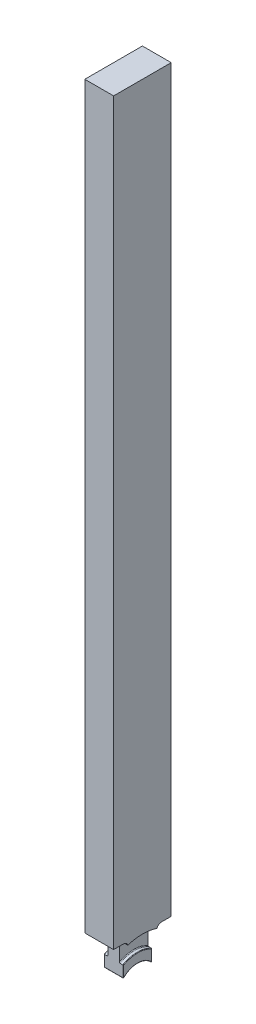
ISO-10303-21;
HEADER;
FILE_DESCRIPTION(('STEP AP214'),'2;1');
FILE_NAME('part.step','',(''),(''),'','','');
FILE_SCHEMA(('AUTOMOTIVE_DESIGN { 1 0 10303 214 1 1 1 1 }'));
ENDSEC;
DATA;
#1=APPLICATION_CONTEXT('core data for automotive mechanical design processes');
#2=APPLICATION_PROTOCOL_DEFINITION('international standard','automotive_design',2000,#1);
#3=PRODUCT_CONTEXT('',#1,'mechanical');
#4=PRODUCT('Part','Part','',(#3));
#5=PRODUCT_RELATED_PRODUCT_CATEGORY('part','',(#4));
#6=PRODUCT_DEFINITION_FORMATION('','',#4);
#7=PRODUCT_DEFINITION_CONTEXT('part definition',#1,'design');
#8=PRODUCT_DEFINITION('design','',#6,#7);
#9=PRODUCT_DEFINITION_SHAPE('','',#8);
#10=(LENGTH_UNIT() NAMED_UNIT(*) SI_UNIT(.MILLI.,.METRE.));
#11=(NAMED_UNIT(*) PLANE_ANGLE_UNIT() SI_UNIT($,.RADIAN.));
#12=(NAMED_UNIT(*) SI_UNIT($,.STERADIAN.) SOLID_ANGLE_UNIT());
#13=UNCERTAINTY_MEASURE_WITH_UNIT(LENGTH_MEASURE(1.E-05),#10,'distance_accuracy_value','');
#14=(GEOMETRIC_REPRESENTATION_CONTEXT(3) GLOBAL_UNCERTAINTY_ASSIGNED_CONTEXT((#13)) GLOBAL_UNIT_ASSIGNED_CONTEXT((#10,
#11,#12)) REPRESENTATION_CONTEXT('',''));
#15=CARTESIAN_POINT('',(0.,0.,0.));
#16=DIRECTION('',(0.,0.,1.));
#17=DIRECTION('',(1.,0.,0.));
#18=AXIS2_PLACEMENT_3D('',#15,#16,#17);
#19=CARTESIAN_POINT('',(7.5,410.,15.));
#20=DIRECTION('',(0.,0.,-1.));
#21=DIRECTION('',(0.,1.,0.));
#22=AXIS2_PLACEMENT_3D('',#19,#20,#21);
#23=PLANE('',#22);
#24=DIRECTION('',(0.,-1.,0.));
#25=VECTOR('',#24,1.);
#26=CARTESIAN_POINT('',(-7.5,410.,15.));
#27=LINE('',#26,#25);
#28=CARTESIAN_POINT('',(-7.5,410.,15.));
#29=VERTEX_POINT('',#28);
#30=CARTESIAN_POINT('',(-7.50000000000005,25.,15.));
#31=VERTEX_POINT('',#30);
#32=EDGE_CURVE('E315',#29,#31,#27,.T.);
#33=ORIENTED_EDGE('',*,*,#32,.T.);
#34=DIRECTION('',(1.,0.,0.));
#35=VECTOR('',#34,1.);
#36=CARTESIAN_POINT('',(7.5,25.,15.));
#37=LINE('',#36,#35);
#38=CARTESIAN_POINT('',(7.50000000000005,25.,15.));
#39=VERTEX_POINT('',#38);
#40=EDGE_CURVE('E294',#31,#39,#37,.T.);
#41=ORIENTED_EDGE('',*,*,#40,.T.);
#42=DIRECTION('',(0.,-1.,0.));
#43=VECTOR('',#42,1.);
#44=CARTESIAN_POINT('',(7.5,410.,15.));
#45=LINE('',#44,#43);
#46=CARTESIAN_POINT('',(7.5,410.,15.));
#47=VERTEX_POINT('',#46);
#48=EDGE_CURVE('E306',#47,#39,#45,.T.);
#49=ORIENTED_EDGE('',*,*,#48,.F.);
#50=DIRECTION('',(-1.,0.,0.));
#51=VECTOR('',#50,1.);
#52=CARTESIAN_POINT('',(7.5,410.,15.));
#53=LINE('',#52,#51);
#54=EDGE_CURVE('E321',#47,#29,#53,.T.);
#55=ORIENTED_EDGE('',*,*,#54,.T.);
#56=EDGE_LOOP('',(#33,#41,#49,#55));
#57=FACE_BOUND('',#56,.T.);
#58=ADVANCED_FACE('F37',(#57),#23,.F.);
#59=CARTESIAN_POINT('',(7.5,410.,-15.));
#60=DIRECTION('',(0.,0.,1.));
#61=DIRECTION('',(0.,-1.,0.));
#62=AXIS2_PLACEMENT_3D('',#59,#60,#61);
#63=PLANE('',#62);
#64=DIRECTION('',(0.,1.,0.));
#65=VECTOR('',#64,1.);
#66=CARTESIAN_POINT('',(7.5,410.,-15.));
#67=LINE('',#66,#65);
#68=CARTESIAN_POINT('',(7.50000000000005,25.,-15.));
#69=VERTEX_POINT('',#68);
#70=CARTESIAN_POINT('',(7.5,410.,-15.));
#71=VERTEX_POINT('',#70);
#72=EDGE_CURVE('E310',#69,#71,#67,.T.);
#73=ORIENTED_EDGE('',*,*,#72,.F.);
#74=DIRECTION('',(-1.,0.,0.));
#75=VECTOR('',#74,1.);
#76=CARTESIAN_POINT('',(7.5,25.,-15.));
#77=LINE('',#76,#75);
#78=CARTESIAN_POINT('',(-7.50000000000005,25.,-15.));
#79=VERTEX_POINT('',#78);
#80=EDGE_CURVE('E233',#69,#79,#77,.T.);
#81=ORIENTED_EDGE('',*,*,#80,.T.);
#82=DIRECTION('',(0.,1.,0.));
#83=VECTOR('',#82,1.);
#84=CARTESIAN_POINT('',(-7.5,410.,-15.));
#85=LINE('',#84,#83);
#86=CARTESIAN_POINT('',(-7.5,410.,-15.));
#87=VERTEX_POINT('',#86);
#88=EDGE_CURVE('E307',#79,#87,#85,.T.);
#89=ORIENTED_EDGE('',*,*,#88,.T.);
#90=DIRECTION('',(-1.,0.,0.));
#91=VECTOR('',#90,1.);
#92=CARTESIAN_POINT('',(7.5,410.,-15.));
#93=LINE('',#92,#91);
#94=EDGE_CURVE('E312',#71,#87,#93,.T.);
#95=ORIENTED_EDGE('',*,*,#94,.F.);
#96=EDGE_LOOP('',(#73,#81,#89,#95));
#97=FACE_BOUND('',#96,.T.);
#98=ADVANCED_FACE('F482',(#97),#63,.F.);
#99=CARTESIAN_POINT('',(-7.5,0.,0.));
#100=DIRECTION('',(-1.,0.,0.));
#101=DIRECTION('',(0.,0.,1.));
#102=AXIS2_PLACEMENT_3D('',#99,#100,#101);
#103=PLANE('',#102);
#104=CARTESIAN_POINT('',(-7.50000000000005,22.6124,-9.8876));
#105=DIRECTION('',(1.,0.,0.));
#106=DIRECTION('',(0.,0.,1.));
#107=AXIS2_PLACEMENT_3D('',#104,#105,#106);
#108=CIRCLE('',#107,2.3876);
#109=CARTESIAN_POINT('',(-7.50000000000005,25.,-9.8876));
#110=VERTEX_POINT('',#109);
#111=CARTESIAN_POINT('',(-7.50000000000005,23.2918345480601,-7.59871327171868));
#112=VERTEX_POINT('',#111);
#113=EDGE_CURVE('E245',#110,#112,#108,.T.);
#114=ORIENTED_EDGE('',*,*,#113,.T.);
#115=CARTESIAN_POINT('',(-7.50000000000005,0.,0.));
#116=DIRECTION('',(-1.,0.,0.));
#117=DIRECTION('',(0.,0.,1.));
#118=AXIS2_PLACEMENT_3D('',#115,#116,#117);
#119=CIRCLE('',#118,24.5);
#120=CARTESIAN_POINT('',(-7.50000000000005,23.2918345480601,7.59871327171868));
#121=VERTEX_POINT('',#120);
#122=EDGE_CURVE('E298',#121,#112,#119,.T.);
#123=ORIENTED_EDGE('',*,*,#122,.F.);
#124=CARTESIAN_POINT('',(-7.50000000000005,22.6124,9.8876));
#125=DIRECTION('',(1.,0.,0.));
#126=DIRECTION('',(0.,0.,-1.));
#127=AXIS2_PLACEMENT_3D('',#124,#125,#126);
#128=CIRCLE('',#127,2.3876);
#129=CARTESIAN_POINT('',(-7.50000000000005,25.,9.8876));
#130=VERTEX_POINT('',#129);
#131=EDGE_CURVE('E265',#121,#130,#128,.T.);
#132=ORIENTED_EDGE('',*,*,#131,.T.);
#133=DIRECTION('',(0.,0.,1.));
#134=VECTOR('',#133,1.);
#135=CARTESIAN_POINT('',(-7.50000000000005,25.,9.8876));
#136=LINE('',#135,#134);
#137=EDGE_CURVE('E268',#130,#31,#136,.T.);
#138=ORIENTED_EDGE('',*,*,#137,.T.);
#139=ORIENTED_EDGE('',*,*,#32,.F.);
#140=DIRECTION('',(0.,0.,1.));
#141=VECTOR('',#140,1.);
#142=CARTESIAN_POINT('',(-7.5,410.,15.));
#143=LINE('',#142,#141);
#144=EDGE_CURVE('E300',#87,#29,#143,.T.);
#145=ORIENTED_EDGE('',*,*,#144,.F.);
#146=ORIENTED_EDGE('',*,*,#88,.F.);
#147=DIRECTION('',(0.,0.,1.));
#148=VECTOR('',#147,1.);
#149=CARTESIAN_POINT('',(-7.50000000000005,25.,-9.8876));
#150=LINE('',#149,#148);
#151=EDGE_CURVE('E254',#79,#110,#150,.T.);
#152=ORIENTED_EDGE('',*,*,#151,.T.);
#153=EDGE_LOOP('',(#114,#123,#132,#138,#139,#145,#146,#152));
#154=FACE_BOUND('',#153,.T.);
#155=ADVANCED_FACE('F487',(#154),#103,.T.);
#156=CARTESIAN_POINT('',(7.5,410.,15.));
#157=DIRECTION('',(0.,-1.,0.));
#158=DIRECTION('',(0.,0.,-1.));
#159=AXIS2_PLACEMENT_3D('',#156,#157,#158);
#160=PLANE('',#159);
#161=ORIENTED_EDGE('',*,*,#144,.T.);
#162=ORIENTED_EDGE('',*,*,#54,.F.);
#163=DIRECTION('',(0.,0.,1.));
#164=VECTOR('',#163,1.);
#165=CARTESIAN_POINT('',(7.5,410.,15.));
#166=LINE('',#165,#164);
#167=EDGE_CURVE('E303',#71,#47,#166,.T.);
#168=ORIENTED_EDGE('',*,*,#167,.F.);
#169=ORIENTED_EDGE('',*,*,#94,.T.);
#170=EDGE_LOOP('',(#161,#162,#168,#169));
#171=FACE_BOUND('',#170,.T.);
#172=ADVANCED_FACE('F372',(#171),#160,.F.);
#173=CARTESIAN_POINT('',(7.5,0.,0.));
#174=DIRECTION('',(-1.,0.,0.));
#175=DIRECTION('',(0.,0.,1.));
#176=AXIS2_PLACEMENT_3D('',#173,#174,#175);
#177=PLANE('',#176);
#178=CARTESIAN_POINT('',(7.50000000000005,0.,0.));
#179=DIRECTION('',(-1.,0.,0.));
#180=DIRECTION('',(0.,0.,1.));
#181=AXIS2_PLACEMENT_3D('',#178,#179,#180);
#182=CIRCLE('',#181,24.5);
#183=CARTESIAN_POINT('',(7.50000000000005,23.2918345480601,7.59871327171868));
#184=VERTEX_POINT('',#183);
#185=CARTESIAN_POINT('',(7.50000000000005,23.2918345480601,-7.59871327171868));
#186=VERTEX_POINT('',#185);
#187=EDGE_CURVE('E253',#184,#186,#182,.T.);
#188=ORIENTED_EDGE('',*,*,#187,.T.);
#189=CARTESIAN_POINT('',(7.50000000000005,22.6124,-9.8876));
#190=DIRECTION('',(1.,0.,0.));
#191=DIRECTION('',(0.,0.,1.));
#192=AXIS2_PLACEMENT_3D('',#189,#190,#191);
#193=CIRCLE('',#192,2.3876);
#194=CARTESIAN_POINT('',(7.50000000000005,25.,-9.8876));
#195=VERTEX_POINT('',#194);
#196=EDGE_CURVE('E237',#195,#186,#193,.T.);
#197=ORIENTED_EDGE('',*,*,#196,.F.);
#198=DIRECTION('',(0.,0.,1.));
#199=VECTOR('',#198,1.);
#200=CARTESIAN_POINT('',(7.50000000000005,25.,-9.8876));
#201=LINE('',#200,#199);
#202=EDGE_CURVE('E227',#69,#195,#201,.T.);
#203=ORIENTED_EDGE('',*,*,#202,.F.);
#204=ORIENTED_EDGE('',*,*,#72,.T.);
#205=ORIENTED_EDGE('',*,*,#167,.T.);
#206=ORIENTED_EDGE('',*,*,#48,.T.);
#207=DIRECTION('',(0.,0.,1.));
#208=VECTOR('',#207,1.);
#209=CARTESIAN_POINT('',(7.50000000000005,25.,9.8876));
#210=LINE('',#209,#208);
#211=CARTESIAN_POINT('',(7.50000000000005,25.,9.8876));
#212=VERTEX_POINT('',#211);
#213=EDGE_CURVE('E263',#212,#39,#210,.T.);
#214=ORIENTED_EDGE('',*,*,#213,.F.);
#215=CARTESIAN_POINT('',(7.50000000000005,22.6124,9.8876));
#216=DIRECTION('',(1.,0.,0.));
#217=DIRECTION('',(0.,0.,-1.));
#218=AXIS2_PLACEMENT_3D('',#215,#216,#217);
#219=CIRCLE('',#218,2.3876);
#220=EDGE_CURVE('E261',#184,#212,#219,.T.);
#221=ORIENTED_EDGE('',*,*,#220,.F.);
#222=EDGE_LOOP('',(#188,#197,#203,#204,#205,#206,#214,#221));
#223=FACE_BOUND('',#222,.T.);
#224=ADVANCED_FACE('F250',(#223),#177,.F.);
#225=CARTESIAN_POINT('',(-7.5,0.,0.));
#226=DIRECTION('',(1.,0.,0.));
#227=DIRECTION('',(0.,0.,-1.));
#228=AXIS2_PLACEMENT_3D('',#225,#226,#227);
#229=CYLINDRICAL_SURFACE('',#228,10.);
#230=CARTESIAN_POINT('',(-4.746,0.,0.));
#231=DIRECTION('',(1.,0.,0.));
#232=DIRECTION('',(0.,1.,0.));
#233=AXIS2_PLACEMENT_3D('',#230,#231,#232);
#234=CIRCLE('',#233,10.);
#235=CARTESIAN_POINT('',(-4.746,7.07562205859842,7.06651062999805));
#236=VERTEX_POINT('',#235);
#237=CARTESIAN_POINT('',(-4.746,7.07562205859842,-7.06651062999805));
#238=VERTEX_POINT('',#237);
#239=EDGE_CURVE('E960',#236,#238,#234,.F.);
#240=ORIENTED_EDGE('',*,*,#239,.T.);
#241=DIRECTION('',(1.,0.,0.));
#242=VECTOR('',#241,1.);
#243=CARTESIAN_POINT('',(-7.5,7.07562205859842,-7.06651062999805));
#244=LINE('',#243,#242);
#245=CARTESIAN_POINT('',(4.746,7.07562205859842,-7.06651062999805));
#246=VERTEX_POINT('',#245);
#247=EDGE_CURVE('E969',#238,#246,#244,.T.);
#248=ORIENTED_EDGE('',*,*,#247,.T.);
#249=CARTESIAN_POINT('',(4.746,0.,0.));
#250=DIRECTION('',(-1.,0.,0.));
#251=DIRECTION('',(0.,-1.,0.));
#252=AXIS2_PLACEMENT_3D('',#249,#250,#251);
#253=CIRCLE('',#252,10.);
#254=CARTESIAN_POINT('',(4.746,7.07562205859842,7.06651062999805));
#255=VERTEX_POINT('',#254);
#256=EDGE_CURVE('E966',#246,#255,#253,.F.);
#257=ORIENTED_EDGE('',*,*,#256,.T.);
#258=DIRECTION('',(1.,0.,0.));
#259=VECTOR('',#258,1.);
#260=CARTESIAN_POINT('',(-7.5,7.07562205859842,7.06651062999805));
#261=LINE('',#260,#259);
#262=EDGE_CURVE('E958',#255,#236,#261,.F.);
#263=ORIENTED_EDGE('',*,*,#262,.T.);
#264=EDGE_LOOP('',(#240,#248,#257,#263));
#265=FACE_BOUND('',#264,.T.);
#266=ADVANCED_FACE('F496',(#265),#229,.F.);
#267=CARTESIAN_POINT('',(-3.,15.,0.));
#268=DIRECTION('',(-1.,0.,0.));
#269=DIRECTION('',(0.,0.,1.));
#270=AXIS2_PLACEMENT_3D('',#267,#268,#269);
#271=PLANE('',#270);
#272=DIRECTION('',(0.,1.,0.));
#273=VECTOR('',#272,1.);
#274=CARTESIAN_POINT('',(-3.,15.,-7.5));
#275=LINE('',#274,#273);
#276=CARTESIAN_POINT('',(-3.,13.428520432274,-7.5));
#277=VERTEX_POINT('',#276);
#278=CARTESIAN_POINT('',(-3.,22.5220479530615,-7.5));
#279=VERTEX_POINT('',#278);
#280=EDGE_CURVE('E287',#277,#279,#275,.T.);
#281=ORIENTED_EDGE('',*,*,#280,.F.);
#282=CARTESIAN_POINT('',(-3.,0.,0.));
#283=DIRECTION('',(-1.,0.,0.));
#284=DIRECTION('',(0.,0.,1.));
#285=AXIS2_PLACEMENT_3D('',#282,#283,#284);
#286=CIRCLE('',#285,15.381);
#287=CARTESIAN_POINT('',(-3.,13.428520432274,7.5));
#288=VERTEX_POINT('',#287);
#289=EDGE_CURVE('E421',#277,#288,#286,.F.);
#290=ORIENTED_EDGE('',*,*,#289,.T.);
#291=DIRECTION('',(0.,-1.,0.));
#292=VECTOR('',#291,1.);
#293=CARTESIAN_POINT('',(-3.,15.,7.5));
#294=LINE('',#293,#292);
#295=CARTESIAN_POINT('',(-3.,22.5220479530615,7.5));
#296=VERTEX_POINT('',#295);
#297=EDGE_CURVE('E279',#296,#288,#294,.T.);
#298=ORIENTED_EDGE('',*,*,#297,.F.);
#299=CARTESIAN_POINT('',(-3.,0.,0.));
#300=DIRECTION('',(-1.,0.,0.));
#301=DIRECTION('',(0.,0.,1.));
#302=AXIS2_PLACEMENT_3D('',#299,#300,#301);
#303=CIRCLE('',#302,23.738);
#304=EDGE_CURVE('E333',#296,#279,#303,.T.);
#305=ORIENTED_EDGE('',*,*,#304,.T.);
#306=EDGE_LOOP('',(#281,#290,#298,#305));
#307=FACE_BOUND('',#306,.T.);
#308=ADVANCED_FACE('F499',(#307),#271,.T.);
#309=CARTESIAN_POINT('',(-8.84822894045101,0.,0.));
#310=DIRECTION('',(-1.,0.,0.));
#311=DIRECTION('',(0.,0.,1.));
#312=AXIS2_PLACEMENT_3D('',#309,#310,#311);
#313=CYLINDRICAL_SURFACE('',#312,24.5);
#314=DIRECTION('',(1.,0.,0.));
#315=VECTOR('',#314,1.);
#316=CARTESIAN_POINT('',(0.,23.2918345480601,-7.59871327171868));
#317=LINE('',#316,#315);
#318=CARTESIAN_POINT('',(-3.762,23.2918345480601,-7.59871327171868));
#319=VERTEX_POINT('',#318);
#320=EDGE_CURVE('E292',#319,#112,#317,.F.);
#321=ORIENTED_EDGE('',*,*,#320,.F.);
#322=CARTESIAN_POINT('',(-3.762,0.,0.));
#323=DIRECTION('',(-1.,0.,0.));
#324=DIRECTION('',(0.,0.,1.));
#325=AXIS2_PLACEMENT_3D('',#322,#323,#324);
#326=CIRCLE('',#325,24.5);
#327=CARTESIAN_POINT('',(-3.762,23.2918345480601,7.59871327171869));
#328=VERTEX_POINT('',#327);
#329=EDGE_CURVE('E336',#319,#328,#326,.F.);
#330=ORIENTED_EDGE('',*,*,#329,.T.);
#331=DIRECTION('',(1.,0.,0.));
#332=VECTOR('',#331,1.);
#333=CARTESIAN_POINT('',(0.,23.2918345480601,7.59871327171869));
#334=LINE('',#333,#332);
#335=EDGE_CURVE('E289',#121,#328,#334,.T.);
#336=ORIENTED_EDGE('',*,*,#335,.F.);
#337=ORIENTED_EDGE('',*,*,#122,.T.);
#338=EDGE_LOOP('',(#321,#330,#336,#337));
#339=FACE_BOUND('',#338,.T.);
#340=ADVANCED_FACE('F501',(#339),#313,.F.);
#341=CARTESIAN_POINT('',(-8.84822894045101,0.,0.));
#342=DIRECTION('',(-1.,0.,0.));
#343=DIRECTION('',(0.,0.,1.));
#344=AXIS2_PLACEMENT_3D('',#341,#342,#343);
#345=CYLINDRICAL_SURFACE('',#344,15.);
#346=DIRECTION('',(-1.,0.,0.));
#347=VECTOR('',#346,1.);
#348=CARTESIAN_POINT('',(-8.84822894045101,12.9903810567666,-7.5));
#349=LINE('',#348,#347);
#350=CARTESIAN_POINT('',(-4.746,12.9903810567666,-7.5));
#351=VERTEX_POINT('',#350);
#352=CARTESIAN_POINT('',(-3.381,12.9903810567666,-7.5));
#353=VERTEX_POINT('',#352);
#354=EDGE_CURVE('E285',#351,#353,#349,.F.);
#355=ORIENTED_EDGE('',*,*,#354,.F.);
#356=CARTESIAN_POINT('',(-4.746,0.,0.));
#357=DIRECTION('',(1.,0.,0.));
#358=DIRECTION('',(0.,1.,0.));
#359=AXIS2_PLACEMENT_3D('',#356,#357,#358);
#360=CIRCLE('',#359,15.);
#361=CARTESIAN_POINT('',(-4.746,12.9903810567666,7.5));
#362=VERTEX_POINT('',#361);
#363=EDGE_CURVE('E11',#351,#362,#360,.T.);
#364=ORIENTED_EDGE('',*,*,#363,.T.);
#365=DIRECTION('',(-1.,0.,0.));
#366=VECTOR('',#365,1.);
#367=CARTESIAN_POINT('',(-8.84822894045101,12.9903810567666,7.5));
#368=LINE('',#367,#366);
#369=CARTESIAN_POINT('',(-3.381,12.9903810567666,7.5));
#370=VERTEX_POINT('',#369);
#371=EDGE_CURVE('E276',#370,#362,#368,.T.);
#372=ORIENTED_EDGE('',*,*,#371,.F.);
#373=CARTESIAN_POINT('',(-3.381,0.,0.));
#374=DIRECTION('',(-1.,0.,0.));
#375=DIRECTION('',(0.,0.,1.));
#376=AXIS2_PLACEMENT_3D('',#373,#374,#375);
#377=CIRCLE('',#376,15.);
#378=EDGE_CURVE('E412',#370,#353,#377,.T.);
#379=ORIENTED_EDGE('',*,*,#378,.T.);
#380=EDGE_LOOP('',(#355,#364,#372,#379));
#381=FACE_BOUND('',#380,.T.);
#382=ADVANCED_FACE('F504',(#381),#345,.T.);
#383=CARTESIAN_POINT('',(3.,15.,0.));
#384=DIRECTION('',(1.,0.,0.));
#385=DIRECTION('',(0.,0.,-1.));
#386=AXIS2_PLACEMENT_3D('',#383,#384,#385);
#387=PLANE('',#386);
#388=DIRECTION('',(0.,1.,0.));
#389=VECTOR('',#388,1.);
#390=CARTESIAN_POINT('',(3.,15.,7.5));
#391=LINE('',#390,#389);
#392=CARTESIAN_POINT('',(3.,13.428520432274,7.5));
#393=VERTEX_POINT('',#392);
#394=CARTESIAN_POINT('',(3.,22.5220479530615,7.5));
#395=VERTEX_POINT('',#394);
#396=EDGE_CURVE('E259',#393,#395,#391,.T.);
#397=ORIENTED_EDGE('',*,*,#396,.F.);
#398=CARTESIAN_POINT('',(3.,0.,0.));
#399=DIRECTION('',(1.,0.,0.));
#400=DIRECTION('',(0.,0.,-1.));
#401=AXIS2_PLACEMENT_3D('',#398,#399,#400);
#402=CIRCLE('',#401,15.381);
#403=CARTESIAN_POINT('',(3.,13.428520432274,-7.5));
#404=VERTEX_POINT('',#403);
#405=EDGE_CURVE('E423',#393,#404,#402,.F.);
#406=ORIENTED_EDGE('',*,*,#405,.T.);
#407=DIRECTION('',(0.,-1.,0.));
#408=VECTOR('',#407,1.);
#409=CARTESIAN_POINT('',(3.,15.,-7.5));
#410=LINE('',#409,#408);
#411=CARTESIAN_POINT('',(3.,22.5220479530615,-7.5));
#412=VERTEX_POINT('',#411);
#413=EDGE_CURVE('E282',#412,#404,#410,.T.);
#414=ORIENTED_EDGE('',*,*,#413,.F.);
#415=CARTESIAN_POINT('',(3.,0.,0.));
#416=DIRECTION('',(1.,0.,0.));
#417=DIRECTION('',(0.,0.,-1.));
#418=AXIS2_PLACEMENT_3D('',#415,#416,#417);
#419=CIRCLE('',#418,23.738);
#420=EDGE_CURVE('E341',#412,#395,#419,.T.);
#421=ORIENTED_EDGE('',*,*,#420,.T.);
#422=EDGE_LOOP('',(#397,#406,#414,#421));
#423=FACE_BOUND('',#422,.T.);
#424=ADVANCED_FACE('F508',(#423),#387,.T.);
#425=CARTESIAN_POINT('',(-8.84822894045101,0.,0.));
#426=DIRECTION('',(-1.,0.,0.));
#427=DIRECTION('',(0.,0.,1.));
#428=AXIS2_PLACEMENT_3D('',#425,#426,#427);
#429=CYLINDRICAL_SURFACE('',#428,24.5);
#430=DIRECTION('',(1.,0.,0.));
#431=VECTOR('',#430,1.);
#432=CARTESIAN_POINT('',(0.,23.2918345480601,7.59871327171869));
#433=LINE('',#432,#431);
#434=CARTESIAN_POINT('',(3.762,23.2918345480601,7.59871327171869));
#435=VERTEX_POINT('',#434);
#436=EDGE_CURVE('E329',#435,#184,#433,.T.);
#437=ORIENTED_EDGE('',*,*,#436,.F.);
#438=CARTESIAN_POINT('',(3.762,0.,0.));
#439=DIRECTION('',(1.,0.,0.));
#440=DIRECTION('',(0.,0.,-1.));
#441=AXIS2_PLACEMENT_3D('',#438,#439,#440);
#442=CIRCLE('',#441,24.5);
#443=CARTESIAN_POINT('',(3.762,23.2918345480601,-7.59871327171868));
#444=VERTEX_POINT('',#443);
#445=EDGE_CURVE('E338',#435,#444,#442,.F.);
#446=ORIENTED_EDGE('',*,*,#445,.T.);
#447=DIRECTION('',(1.,0.,0.));
#448=VECTOR('',#447,1.);
#449=CARTESIAN_POINT('',(0.,23.2918345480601,-7.59871327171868));
#450=LINE('',#449,#448);
#451=EDGE_CURVE('E331',#186,#444,#450,.F.);
#452=ORIENTED_EDGE('',*,*,#451,.F.);
#453=ORIENTED_EDGE('',*,*,#187,.F.);
#454=EDGE_LOOP('',(#437,#446,#452,#453));
#455=FACE_BOUND('',#454,.T.);
#456=ADVANCED_FACE('F401',(#455),#429,.F.);
#457=CARTESIAN_POINT('',(-8.84822894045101,0.,0.));
#458=DIRECTION('',(-1.,0.,0.));
#459=DIRECTION('',(0.,0.,1.));
#460=AXIS2_PLACEMENT_3D('',#457,#458,#459);
#461=CYLINDRICAL_SURFACE('',#460,15.);
#462=DIRECTION('',(-1.,0.,0.));
#463=VECTOR('',#462,1.);
#464=CARTESIAN_POINT('',(-8.84822894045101,12.9903810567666,7.5));
#465=LINE('',#464,#463);
#466=CARTESIAN_POINT('',(4.746,12.9903810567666,7.5));
#467=VERTEX_POINT('',#466);
#468=CARTESIAN_POINT('',(3.381,12.9903810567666,7.5));
#469=VERTEX_POINT('',#468);
#470=EDGE_CURVE('E324',#467,#469,#465,.T.);
#471=ORIENTED_EDGE('',*,*,#470,.F.);
#472=CARTESIAN_POINT('',(4.746,0.,0.));
#473=DIRECTION('',(-1.,0.,0.));
#474=DIRECTION('',(0.,-1.,0.));
#475=AXIS2_PLACEMENT_3D('',#472,#473,#474);
#476=CIRCLE('',#475,15.);
#477=CARTESIAN_POINT('',(4.746,12.9903810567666,-7.5));
#478=VERTEX_POINT('',#477);
#479=EDGE_CURVE('E977',#467,#478,#476,.T.);
#480=ORIENTED_EDGE('',*,*,#479,.T.);
#481=DIRECTION('',(-1.,0.,0.));
#482=VECTOR('',#481,1.);
#483=CARTESIAN_POINT('',(-8.84822894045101,12.9903810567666,-7.5));
#484=LINE('',#483,#482);
#485=CARTESIAN_POINT('',(3.381,12.9903810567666,-7.5));
#486=VERTEX_POINT('',#485);
#487=EDGE_CURVE('E326',#486,#478,#484,.F.);
#488=ORIENTED_EDGE('',*,*,#487,.F.);
#489=CARTESIAN_POINT('',(3.381,0.,0.));
#490=DIRECTION('',(1.,0.,0.));
#491=DIRECTION('',(0.,0.,-1.));
#492=AXIS2_PLACEMENT_3D('',#489,#490,#491);
#493=CIRCLE('',#492,15.);
#494=EDGE_CURVE('E426',#486,#469,#493,.T.);
#495=ORIENTED_EDGE('',*,*,#494,.T.);
#496=EDGE_LOOP('',(#471,#480,#488,#495));
#497=FACE_BOUND('',#496,.T.);
#498=ADVANCED_FACE('F479',(#497),#461,.T.);
#499=CARTESIAN_POINT('',(-7.50000000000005,25.,9.8876));
#500=DIRECTION('',(0.,1.,0.));
#501=DIRECTION('',(0.,0.,1.));
#502=AXIS2_PLACEMENT_3D('',#499,#500,#501);
#503=PLANE('',#502);
#504=ORIENTED_EDGE('',*,*,#137,.F.);
#505=DIRECTION('',(1.,0.,0.));
#506=VECTOR('',#505,1.);
#507=CARTESIAN_POINT('',(-7.50000000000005,25.,9.8876));
#508=LINE('',#507,#506);
#509=EDGE_CURVE('E271',#130,#212,#508,.T.);
#510=ORIENTED_EDGE('',*,*,#509,.T.);
#511=ORIENTED_EDGE('',*,*,#213,.T.);
#512=ORIENTED_EDGE('',*,*,#40,.F.);
#513=EDGE_LOOP('',(#504,#510,#511,#512));
#514=FACE_BOUND('',#513,.T.);
#515=ADVANCED_FACE('F400',(#514),#503,.F.);
#516=CARTESIAN_POINT('',(-7.50000000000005,0.,7.5));
#517=DIRECTION('',(0.,0.,-1.));
#518=DIRECTION('',(0.,1.,0.));
#519=AXIS2_PLACEMENT_3D('',#516,#517,#518);
#520=PLANE('',#519);
#521=DIRECTION('',(1.,0.,0.));
#522=VECTOR('',#521,1.);
#523=CARTESIAN_POINT('',(-7.50000000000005,7.25534285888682,7.5));
#524=LINE('',#523,#522);
#525=CARTESIAN_POINT('',(-4.746,7.25534285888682,7.5));
#526=VERTEX_POINT('',#525);
#527=CARTESIAN_POINT('',(4.746,7.25534285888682,7.5));
#528=VERTEX_POINT('',#527);
#529=EDGE_CURVE('E971',#526,#528,#524,.T.);
#530=ORIENTED_EDGE('',*,*,#529,.T.);
#531=DIRECTION('',(0.,1.,0.));
#532=VECTOR('',#531,1.);
#533=CARTESIAN_POINT('',(4.746,0.,7.5));
#534=LINE('',#533,#532);
#535=EDGE_CURVE('E975',#528,#467,#534,.T.);
#536=ORIENTED_EDGE('',*,*,#535,.T.);
#537=ORIENTED_EDGE('',*,*,#470,.T.);
#538=CARTESIAN_POINT('',(3.381,12.9903810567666,7.5));
#539=CARTESIAN_POINT('',(3.36159348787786,12.9903515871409,7.5));
#540=CARTESIAN_POINT('',(3.34220939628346,12.9920910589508,7.5));
#541=CARTESIAN_POINT('',(3.30411089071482,12.9988686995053,7.5));
#542=CARTESIAN_POINT('',(3.28539391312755,13.0038923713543,7.5));
#543=CARTESIAN_POINT('',(3.24909102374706,13.0169971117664,7.5));
#544=CARTESIAN_POINT('',(3.23150411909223,13.0250754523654,7.5));
#545=CARTESIAN_POINT('',(3.19783116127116,13.0439266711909,7.5));
#546=CARTESIAN_POINT('',(3.18174642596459,13.054701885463,7.5));
#547=CARTESIAN_POINT('',(3.15058262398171,13.0791681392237,7.5));
#548=CARTESIAN_POINT('',(3.1356009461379,13.0929827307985,7.5));
#549=CARTESIAN_POINT('',(3.10785285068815,13.1226713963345,7.5));
#550=CARTESIAN_POINT('',(3.09508691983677,13.1385459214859,7.5));
#551=CARTESIAN_POINT('',(3.07041818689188,13.174041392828,7.5));
#552=CARTESIAN_POINT('',(3.05883169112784,13.1938820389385,7.5));
#553=CARTESIAN_POINT('',(3.03871875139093,13.235070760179,7.5));
#554=CARTESIAN_POINT('',(3.03019562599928,13.2564204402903,7.5));
#555=CARTESIAN_POINT('',(3.01549657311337,13.3025258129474,7.5));
#556=CARTESIAN_POINT('',(3.00968374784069,13.327397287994,7.5));
#557=CARTESIAN_POINT('',(3.00193752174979,13.3776913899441,7.5));
#558=CARTESIAN_POINT('',(2.99999691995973,13.4031129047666,7.5));
#559=CARTESIAN_POINT('',(3.,13.428520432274,7.5));
#560=B_SPLINE_CURVE_WITH_KNOTS('',3,(#538,#539,#540,#541,#542,#543,#544,#545,#546,#547,#548,
#549,#550,#551,#552,#553,#554,#555,#556,#557,#558,#559),.UNSPECIFIED.,.F.,.F.,(4,2,2,2,2,2,2,2,
2,2,4),(0.,0.0581065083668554,0.115958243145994,0.173758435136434,0.231608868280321,
0.292501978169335,0.35340844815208,0.422061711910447,0.490789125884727,0.567105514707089,
0.643279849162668),.UNSPECIFIED.);
#561=EDGE_CURVE('E462',#469,#393,#560,.T.);
#562=ORIENTED_EDGE('',*,*,#561,.T.);
#563=ORIENTED_EDGE('',*,*,#396,.T.);
#564=CARTESIAN_POINT('',(3.,22.5220479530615,7.5));
#565=CARTESIAN_POINT('',(3.00000022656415,22.5371498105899,7.5));
#566=CARTESIAN_POINT('',(3.0004036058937,22.5522300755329,7.5));
#567=CARTESIAN_POINT('',(3.00201667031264,22.5823474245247,7.5));
#568=CARTESIAN_POINT('',(3.003226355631,22.5973845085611,7.5));
#569=CARTESIAN_POINT('',(3.00483919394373,22.6124,7.5));
#570=B_SPLINE_CURVE_WITH_KNOTS('',3,(#564,#565,#566,#567,#568,#569),.UNSPECIFIED.,.F.,.F.,(4,2,
4),(0.,0.045256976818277,0.0905139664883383),.UNSPECIFIED.);
#571=CARTESIAN_POINT('',(3.00483919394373,22.6124,7.5));
#572=VERTEX_POINT('',#571);
#573=EDGE_CURVE('E413',#395,#572,#570,.T.);
#574=ORIENTED_EDGE('',*,*,#573,.T.);
#575=DIRECTION('',(1.,0.,0.));
#576=VECTOR('',#575,1.);
#577=CARTESIAN_POINT('',(-7.50000000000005,22.6124,7.5));
#578=LINE('',#577,#576);
#579=CARTESIAN_POINT('',(-3.00483919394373,22.6124,7.5));
#580=VERTEX_POINT('',#579);
#581=EDGE_CURVE('E238',#580,#572,#578,.T.);
#582=ORIENTED_EDGE('',*,*,#581,.F.);
#583=CARTESIAN_POINT('',(-3.00483919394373,22.6124,7.5));
#584=CARTESIAN_POINT('',(-3.003226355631,22.5973845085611,7.5));
#585=CARTESIAN_POINT('',(-3.00201667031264,22.5823474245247,7.5));
#586=CARTESIAN_POINT('',(-3.0004036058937,22.5522300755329,7.5));
#587=CARTESIAN_POINT('',(-3.00000022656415,22.5371498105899,7.5));
#588=CARTESIAN_POINT('',(-3.,22.5220479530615,7.5));
#589=B_SPLINE_CURVE_WITH_KNOTS('',3,(#583,#584,#585,#586,#587,#588),.UNSPECIFIED.,.F.,.F.,(4,2,
4),(0.,0.0452569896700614,0.0905139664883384),.UNSPECIFIED.);
#590=EDGE_CURVE('E387',#580,#296,#589,.T.);
#591=ORIENTED_EDGE('',*,*,#590,.T.);
#592=ORIENTED_EDGE('',*,*,#297,.T.);
#593=CARTESIAN_POINT('',(-3.,13.428520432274,7.5));
#594=CARTESIAN_POINT('',(-2.99998773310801,13.3960473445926,7.5));
#595=CARTESIAN_POINT('',(-3.00316588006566,13.3635248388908,7.5));
#596=CARTESIAN_POINT('',(-3.01585357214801,13.2995632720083,7.5));
#597=CARTESIAN_POINT('',(-3.02539701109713,13.2681309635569,7.5));
#598=CARTESIAN_POINT('',(-3.04884901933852,13.2124568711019,7.5));
#599=CARTESIAN_POINT('',(-3.06188078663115,13.1878460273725,7.5));
#600=CARTESIAN_POINT('',(-3.09231245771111,13.1415402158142,7.5));
#601=CARTESIAN_POINT('',(-3.10970093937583,13.1198378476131,7.5));
#602=CARTESIAN_POINT('',(-3.14655915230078,13.0824144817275,7.5));
#603=CARTESIAN_POINT('',(-3.16563766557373,13.0663097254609,7.5));
#604=CARTESIAN_POINT('',(-3.20659393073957,13.0381967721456,7.5));
#605=CARTESIAN_POINT('',(-3.22846666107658,13.0261813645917,7.5));
#606=CARTESIAN_POINT('',(-3.27177499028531,13.0081040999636,7.5));
#607=CARTESIAN_POINT('',(-3.2929987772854,13.0015363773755,7.5));
#608=CARTESIAN_POINT('',(-3.33646159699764,12.9926369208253,7.5));
#609=CARTESIAN_POINT('',(-3.35870658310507,12.9903344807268,7.5));
#610=CARTESIAN_POINT('',(-3.381,12.9903810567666,7.5));
#611=B_SPLINE_CURVE_WITH_KNOTS('',3,(#593,#594,#595,#596,#597,#598,#599,#600,#601,#602,#603,
#604,#605,#606,#607,#608,#609,#610),.UNSPECIFIED.,.F.,.F.,(4,2,2,2,2,2,2,2,4),(0.,
0.0973546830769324,0.195231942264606,0.278328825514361,0.361210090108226,0.435666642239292,
0.509991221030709,0.576221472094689,0.642904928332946),.UNSPECIFIED.);
#612=EDGE_CURVE('E435',#288,#370,#611,.T.);
#613=ORIENTED_EDGE('',*,*,#612,.T.);
#614=ORIENTED_EDGE('',*,*,#371,.T.);
#615=DIRECTION('',(0.,-1.,0.));
#616=VECTOR('',#615,1.);
#617=CARTESIAN_POINT('',(-4.746,0.,7.5));
#618=LINE('',#617,#616);
#619=EDGE_CURVE('E973',#362,#526,#618,.T.);
#620=ORIENTED_EDGE('',*,*,#619,.T.);
#621=EDGE_LOOP('',(#530,#536,#537,#562,#563,#574,#582,#591,#592,#613,#614,#620));
#622=FACE_BOUND('',#621,.T.);
#623=ADVANCED_FACE('F398',(#622),#520,.F.);
#624=CARTESIAN_POINT('',(-7.50000000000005,22.6124,9.8876));
#625=DIRECTION('',(1.,0.,0.));
#626=DIRECTION('',(0.,0.,-1.));
#627=AXIS2_PLACEMENT_3D('',#624,#625,#626);
#628=CYLINDRICAL_SURFACE('',#627,2.3876);
#629=ORIENTED_EDGE('',*,*,#335,.T.);
#630=CARTESIAN_POINT('',(-3.762,23.2918345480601,7.59871327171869));
#631=CARTESIAN_POINT('',(-3.71922808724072,23.2918594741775,7.59875477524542));
#632=CARTESIAN_POINT('',(-3.67646565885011,23.2883828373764,7.59768925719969));
#633=CARTESIAN_POINT('',(-3.59216566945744,23.2746068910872,7.59364956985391));
#634=CARTESIAN_POINT('',(-3.55062755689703,23.2643107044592,7.59067627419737));
#635=CARTESIAN_POINT('',(-3.46991739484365,23.2370679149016,7.58312371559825));
#636=CARTESIAN_POINT('',(-3.43074673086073,23.2201174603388,7.57854352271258));
#637=CARTESIAN_POINT('',(-3.35593083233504,23.1799381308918,7.56834044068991));
#638=CARTESIAN_POINT('',(-3.32028456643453,23.1567111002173,7.56271785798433));
#639=CARTESIAN_POINT('',(-3.25372127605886,23.1046516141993,7.55114404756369));
#640=CARTESIAN_POINT('',(-3.22278007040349,23.0758496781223,7.54519473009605));
#641=CARTESIAN_POINT('',(-3.16628996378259,23.0132927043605,7.53368252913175));
#642=CARTESIAN_POINT('',(-3.14074149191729,22.9795372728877,7.52811967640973));
#643=CARTESIAN_POINT('',(-3.09610184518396,22.9086206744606,7.51818070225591));
#644=CARTESIAN_POINT('',(-3.07691336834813,22.8715230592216,7.51378692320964));
#645=CARTESIAN_POINT('',(-3.04484920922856,22.794565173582,7.50664707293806));
#646=CARTESIAN_POINT('',(-3.03196803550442,22.7547073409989,7.50389956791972));
#647=CARTESIAN_POINT('',(-3.01830076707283,22.6973409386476,7.50145187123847));
#648=CARTESIAN_POINT('',(-3.01485478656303,22.6804589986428,7.50090969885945));
#649=CARTESIAN_POINT('',(-3.00904449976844,22.6465389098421,7.50018403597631));
#650=CARTESIAN_POINT('',(-3.00667792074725,22.6295011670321,7.49999978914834));
#651=CARTESIAN_POINT('',(-3.00483919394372,22.6124,7.5));
#652=B_SPLINE_CURVE_WITH_KNOTS('',3,(#630,#631,#632,#633,#634,#635,#636,#637,#638,#639,#640,
#641,#642,#643,#644,#645,#646,#647,#648,#649,#650,#651),.UNSPECIFIED.,.F.,.F.,(4,2,2,2,2,2,2,2,
2,2,4),(0.,0.12814820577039,0.256237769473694,0.384401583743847,0.512527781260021,
0.6399714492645,0.76742525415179,0.892827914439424,1.01812119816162,1.06980651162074,
1.1213824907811),.UNSPECIFIED.);
#653=EDGE_CURVE('E380',#328,#580,#652,.T.);
#654=ORIENTED_EDGE('',*,*,#653,.T.);
#655=ORIENTED_EDGE('',*,*,#581,.T.);
#656=CARTESIAN_POINT('',(3.00483919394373,22.6124,7.5));
#657=CARTESIAN_POINT('',(3.007105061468,22.633483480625,7.49999863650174));
#658=CARTESIAN_POINT('',(3.01017580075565,22.6544729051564,7.50027961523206));
#659=CARTESIAN_POINT('',(3.01794874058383,22.6961371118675,7.50137800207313));
#660=CARTESIAN_POINT('',(3.02265127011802,22.7168118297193,7.50219551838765));
#661=CARTESIAN_POINT('',(3.03922237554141,22.7781061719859,7.50540740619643));
#662=CARTESIAN_POINT('',(3.05356047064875,22.8180535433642,7.5085612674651));
#663=CARTESIAN_POINT('',(3.08867055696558,22.8949111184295,7.51645659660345));
#664=CARTESIAN_POINT('',(3.10945380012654,22.931815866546,7.5212008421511));
#665=CARTESIAN_POINT('',(3.15695146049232,23.0014103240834,7.53164091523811));
#666=CARTESIAN_POINT('',(3.1836623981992,23.0341024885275,7.53733618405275));
#667=CARTESIAN_POINT('',(3.24174399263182,23.0938345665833,7.5488469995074));
#668=CARTESIAN_POINT('',(3.27302113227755,23.1209664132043,7.55465847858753));
#669=CARTESIAN_POINT('',(3.33973570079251,23.1696789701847,7.56581181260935));
#670=CARTESIAN_POINT('',(3.37517555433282,23.1912564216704,7.57115339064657));
#671=CARTESIAN_POINT('',(3.44971025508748,23.2286203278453,7.58080892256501));
#672=CARTESIAN_POINT('',(3.48884754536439,23.2443257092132,7.58510822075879));
#673=CARTESIAN_POINT('',(3.56925551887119,23.2692011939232,7.59207938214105));
#674=CARTESIAN_POINT('',(3.61052361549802,23.2783790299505,7.59475317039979));
#675=CARTESIAN_POINT('',(3.67043784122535,23.2867533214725,7.59720993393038));
#676=CARTESIAN_POINT('',(3.68871036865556,23.2886597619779,7.59777277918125));
#677=CARTESIAN_POINT('',(3.72531926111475,23.2911988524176,7.59852438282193));
#678=CARTESIAN_POINT('',(3.74365545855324,23.2918337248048,7.59871379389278));
#679=CARTESIAN_POINT('',(3.762,23.2918345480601,7.59871327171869));
#680=B_SPLINE_CURVE_WITH_KNOTS('',3,(#656,#657,#658,#659,#660,#661,#662,#663,#664,#665,#666,
#667,#668,#669,#670,#671,#672,#673,#674,#675,#676,#677,#678,#679),.UNSPECIFIED.,.F.,.F.,(4,2,2,
2,2,2,2,2,2,2,2,4),(0.,0.0635808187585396,0.127174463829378,0.254190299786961,0.381429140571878,
0.508593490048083,0.633446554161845,0.758372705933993,0.884965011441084,1.01140710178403,
1.06650851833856,1.12151354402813),.UNSPECIFIED.);
#681=EDGE_CURVE('E405',#572,#435,#680,.T.);
#682=ORIENTED_EDGE('',*,*,#681,.T.);
#683=ORIENTED_EDGE('',*,*,#436,.T.);
#684=ORIENTED_EDGE('',*,*,#220,.T.);
#685=ORIENTED_EDGE('',*,*,#509,.F.);
#686=ORIENTED_EDGE('',*,*,#131,.F.);
#687=EDGE_LOOP('',(#629,#654,#655,#682,#683,#684,#685,#686));
#688=FACE_BOUND('',#687,.T.);
#689=ADVANCED_FACE('F393',(#688),#628,.F.);
#690=CARTESIAN_POINT('',(-7.50000000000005,25.,-9.8876));
#691=DIRECTION('',(0.,1.,0.));
#692=DIRECTION('',(0.,0.,1.));
#693=AXIS2_PLACEMENT_3D('',#690,#691,#692);
#694=PLANE('',#693);
#695=ORIENTED_EDGE('',*,*,#202,.T.);
#696=DIRECTION('',(1.,0.,0.));
#697=VECTOR('',#696,1.);
#698=CARTESIAN_POINT('',(-7.50000000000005,25.,-9.8876));
#699=LINE('',#698,#697);
#700=EDGE_CURVE('E230',#110,#195,#699,.T.);
#701=ORIENTED_EDGE('',*,*,#700,.F.);
#702=ORIENTED_EDGE('',*,*,#151,.F.);
#703=ORIENTED_EDGE('',*,*,#80,.F.);
#704=EDGE_LOOP('',(#695,#701,#702,#703));
#705=FACE_BOUND('',#704,.T.);
#706=ADVANCED_FACE('F229',(#705),#694,.F.);
#707=CARTESIAN_POINT('',(-7.50000000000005,0.,-7.5));
#708=DIRECTION('',(0.,0.,1.));
#709=DIRECTION('',(0.,-1.,0.));
#710=AXIS2_PLACEMENT_3D('',#707,#708,#709);
#711=PLANE('',#710);
#712=ORIENTED_EDGE('',*,*,#487,.T.);
#713=DIRECTION('',(0.,-1.,0.));
#714=VECTOR('',#713,1.);
#715=CARTESIAN_POINT('',(4.746,0.,-7.5));
#716=LINE('',#715,#714);
#717=CARTESIAN_POINT('',(4.746,7.25534285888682,-7.5));
#718=VERTEX_POINT('',#717);
#719=EDGE_CURVE('E943',#478,#718,#716,.T.);
#720=ORIENTED_EDGE('',*,*,#719,.T.);
#721=DIRECTION('',(1.,0.,0.));
#722=VECTOR('',#721,1.);
#723=CARTESIAN_POINT('',(-7.50000000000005,7.25534285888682,-7.5));
#724=LINE('',#723,#722);
#725=CARTESIAN_POINT('',(-4.746,7.25534285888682,-7.5));
#726=VERTEX_POINT('',#725);
#727=EDGE_CURVE('E468',#718,#726,#724,.F.);
#728=ORIENTED_EDGE('',*,*,#727,.T.);
#729=DIRECTION('',(0.,1.,0.));
#730=VECTOR('',#729,1.);
#731=CARTESIAN_POINT('',(-4.746,0.,-7.5));
#732=LINE('',#731,#730);
#733=EDGE_CURVE('E1029',#726,#351,#732,.T.);
#734=ORIENTED_EDGE('',*,*,#733,.T.);
#735=ORIENTED_EDGE('',*,*,#354,.T.);
#736=CARTESIAN_POINT('',(-3.381,12.9903810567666,-7.5));
#737=CARTESIAN_POINT('',(-3.36159348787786,12.9903515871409,-7.5));
#738=CARTESIAN_POINT('',(-3.34220939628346,12.9920910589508,-7.5));
#739=CARTESIAN_POINT('',(-3.30411089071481,12.9988686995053,-7.5));
#740=CARTESIAN_POINT('',(-3.28539391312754,13.0038923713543,-7.5));
#741=CARTESIAN_POINT('',(-3.24909102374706,13.0169971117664,-7.5));
#742=CARTESIAN_POINT('',(-3.23150411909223,13.0250754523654,-7.5));
#743=CARTESIAN_POINT('',(-3.19783116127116,13.0439266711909,-7.5));
#744=CARTESIAN_POINT('',(-3.18174642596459,13.054701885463,-7.5));
#745=CARTESIAN_POINT('',(-3.15058262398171,13.0791681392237,-7.5));
#746=CARTESIAN_POINT('',(-3.1356009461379,13.0929827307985,-7.5));
#747=CARTESIAN_POINT('',(-3.10785285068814,13.1226713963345,-7.5));
#748=CARTESIAN_POINT('',(-3.09508691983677,13.1385459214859,-7.5));
#749=CARTESIAN_POINT('',(-3.07041818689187,13.174041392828,-7.5));
#750=CARTESIAN_POINT('',(-3.05883169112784,13.1938820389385,-7.5));
#751=CARTESIAN_POINT('',(-3.03871875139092,13.235070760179,-7.5));
#752=CARTESIAN_POINT('',(-3.03019562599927,13.2564204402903,-7.5));
#753=CARTESIAN_POINT('',(-3.01549657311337,13.3025258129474,-7.5));
#754=CARTESIAN_POINT('',(-3.00968374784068,13.327397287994,-7.5));
#755=CARTESIAN_POINT('',(-3.00193752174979,13.3776913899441,-7.5));
#756=CARTESIAN_POINT('',(-2.99999691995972,13.4031129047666,-7.5));
#757=CARTESIAN_POINT('',(-3.,13.428520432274,-7.5));
#758=B_SPLINE_CURVE_WITH_KNOTS('',3,(#736,#737,#738,#739,#740,#741,#742,#743,#744,#745,#746,
#747,#748,#749,#750,#751,#752,#753,#754,#755,#756,#757),.UNSPECIFIED.,.F.,.F.,(4,2,2,2,2,2,2,2,
2,2,4),(0.,0.0581065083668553,0.115958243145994,0.173758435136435,0.231608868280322,
0.292501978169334,0.35340844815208,0.422061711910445,0.490789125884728,0.56710551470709,
0.643279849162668),.UNSPECIFIED.);
#759=EDGE_CURVE('E429',#353,#277,#758,.T.);
#760=ORIENTED_EDGE('',*,*,#759,.T.);
#761=ORIENTED_EDGE('',*,*,#280,.T.);
#762=CARTESIAN_POINT('',(-3.,22.5220479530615,-7.5));
#763=CARTESIAN_POINT('',(-3.00000022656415,22.5371498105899,-7.5));
#764=CARTESIAN_POINT('',(-3.0004036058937,22.5522300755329,-7.5));
#765=CARTESIAN_POINT('',(-3.00201667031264,22.5823474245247,-7.5));
#766=CARTESIAN_POINT('',(-3.003226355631,22.5973845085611,-7.5));
#767=CARTESIAN_POINT('',(-3.00483919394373,22.6124,-7.5));
#768=B_SPLINE_CURVE_WITH_KNOTS('',3,(#762,#763,#764,#765,#766,#767),.UNSPECIFIED.,.F.,.F.,(4,2,
4),(0.,0.0452569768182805,0.0905139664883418),.UNSPECIFIED.);
#769=CARTESIAN_POINT('',(-3.00483919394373,22.6124,-7.5));
#770=VERTEX_POINT('',#769);
#771=EDGE_CURVE('E344',#279,#770,#768,.T.);
#772=ORIENTED_EDGE('',*,*,#771,.T.);
#773=DIRECTION('',(1.,0.,0.));
#774=VECTOR('',#773,1.);
#775=CARTESIAN_POINT('',(-7.50000000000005,22.6124,-7.5));
#776=LINE('',#775,#774);
#777=CARTESIAN_POINT('',(3.00483919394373,22.6124,-7.5));
#778=VERTEX_POINT('',#777);
#779=EDGE_CURVE('E247',#770,#778,#776,.T.);
#780=ORIENTED_EDGE('',*,*,#779,.T.);
#781=CARTESIAN_POINT('',(3.00483919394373,22.6124,-7.5));
#782=CARTESIAN_POINT('',(3.003226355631,22.5973845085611,-7.5));
#783=CARTESIAN_POINT('',(3.00201667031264,22.5823474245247,-7.5));
#784=CARTESIAN_POINT('',(3.0004036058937,22.5522300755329,-7.5));
#785=CARTESIAN_POINT('',(3.00000022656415,22.5371498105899,-7.5));
#786=CARTESIAN_POINT('',(3.,22.5220479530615,-7.5));
#787=B_SPLINE_CURVE_WITH_KNOTS('',3,(#781,#782,#783,#784,#785,#786),.UNSPECIFIED.,.F.,.F.,(4,2,
4),(0.,0.0452569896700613,0.0905139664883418),.UNSPECIFIED.);
#788=EDGE_CURVE('E549',#778,#412,#787,.T.);
#789=ORIENTED_EDGE('',*,*,#788,.T.);
#790=ORIENTED_EDGE('',*,*,#413,.T.);
#791=CARTESIAN_POINT('',(3.,13.428520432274,-7.5));
#792=CARTESIAN_POINT('',(2.99998773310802,13.3960473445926,-7.5));
#793=CARTESIAN_POINT('',(3.00316588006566,13.3635248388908,-7.5));
#794=CARTESIAN_POINT('',(3.01585357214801,13.2995632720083,-7.5));
#795=CARTESIAN_POINT('',(3.02539701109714,13.2681309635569,-7.5));
#796=CARTESIAN_POINT('',(3.04884901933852,13.2124568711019,-7.5));
#797=CARTESIAN_POINT('',(3.06188078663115,13.1878460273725,-7.5));
#798=CARTESIAN_POINT('',(3.09231245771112,13.1415402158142,-7.5));
#799=CARTESIAN_POINT('',(3.10970093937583,13.1198378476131,-7.5));
#800=CARTESIAN_POINT('',(3.14655915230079,13.0824144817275,-7.5));
#801=CARTESIAN_POINT('',(3.16563766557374,13.0663097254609,-7.5));
#802=CARTESIAN_POINT('',(3.20659393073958,13.0381967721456,-7.5));
#803=CARTESIAN_POINT('',(3.22846666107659,13.0261813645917,-7.5));
#804=CARTESIAN_POINT('',(3.27177499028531,13.0081040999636,-7.5));
#805=CARTESIAN_POINT('',(3.2929987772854,13.0015363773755,-7.5));
#806=CARTESIAN_POINT('',(3.33646159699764,12.9926369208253,-7.5));
#807=CARTESIAN_POINT('',(3.35870658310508,12.9903344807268,-7.5));
#808=CARTESIAN_POINT('',(3.381,12.9903810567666,-7.5));
#809=B_SPLINE_CURVE_WITH_KNOTS('',3,(#791,#792,#793,#794,#795,#796,#797,#798,#799,#800,#801,
#802,#803,#804,#805,#806,#807,#808),.UNSPECIFIED.,.F.,.F.,(4,2,2,2,2,2,2,2,4),(0.,
0.0973546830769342,0.195231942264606,0.278328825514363,0.36121009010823,0.435666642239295,
0.509991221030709,0.576221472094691,0.64290492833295),.UNSPECIFIED.);
#810=EDGE_CURVE('E456',#404,#486,#809,.T.);
#811=ORIENTED_EDGE('',*,*,#810,.T.);
#812=EDGE_LOOP('',(#712,#720,#728,#734,#735,#760,#761,#772,#780,#789,#790,#811));
#813=FACE_BOUND('',#812,.T.);
#814=ADVANCED_FACE('F360',(#813),#711,.F.);
#815=CARTESIAN_POINT('',(-7.50000000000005,22.6124,-9.8876));
#816=DIRECTION('',(1.,0.,0.));
#817=DIRECTION('',(0.,0.,-1.));
#818=AXIS2_PLACEMENT_3D('',#815,#816,#817);
#819=CYLINDRICAL_SURFACE('',#818,2.3876);
#820=ORIENTED_EDGE('',*,*,#779,.F.);
#821=CARTESIAN_POINT('',(-3.00483919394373,22.6124,-7.5));
#822=CARTESIAN_POINT('',(-3.007105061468,22.633483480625,-7.49999863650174));
#823=CARTESIAN_POINT('',(-3.01017580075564,22.6544729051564,-7.50027961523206));
#824=CARTESIAN_POINT('',(-3.01794874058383,22.6961371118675,-7.50137800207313));
#825=CARTESIAN_POINT('',(-3.02265127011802,22.7168118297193,-7.50219551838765));
#826=CARTESIAN_POINT('',(-3.03922237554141,22.7781061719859,-7.50540740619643));
#827=CARTESIAN_POINT('',(-3.05356047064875,22.8180535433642,-7.5085612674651));
#828=CARTESIAN_POINT('',(-3.08867055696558,22.8949111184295,-7.51645659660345));
#829=CARTESIAN_POINT('',(-3.10945380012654,22.931815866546,-7.5212008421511));
#830=CARTESIAN_POINT('',(-3.15695146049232,23.0014103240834,-7.53164091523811));
#831=CARTESIAN_POINT('',(-3.1836623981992,23.0341024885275,-7.53733618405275));
#832=CARTESIAN_POINT('',(-3.24174399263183,23.0938345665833,-7.5488469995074));
#833=CARTESIAN_POINT('',(-3.27302113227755,23.1209664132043,-7.55465847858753));
#834=CARTESIAN_POINT('',(-3.33973570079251,23.1696789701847,-7.56581181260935));
#835=CARTESIAN_POINT('',(-3.37517555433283,23.1912564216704,-7.57115339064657));
#836=CARTESIAN_POINT('',(-3.44971025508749,23.2286203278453,-7.58080892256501));
#837=CARTESIAN_POINT('',(-3.4888475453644,23.2443257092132,-7.58510822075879));
#838=CARTESIAN_POINT('',(-3.5692555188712,23.2692011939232,-7.59207938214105));
#839=CARTESIAN_POINT('',(-3.61052361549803,23.2783790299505,-7.59475317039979));
#840=CARTESIAN_POINT('',(-3.67043784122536,23.2867533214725,-7.59720993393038));
#841=CARTESIAN_POINT('',(-3.68871036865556,23.2886597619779,-7.59777277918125));
#842=CARTESIAN_POINT('',(-3.72531926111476,23.2911988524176,-7.59852438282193));
#843=CARTESIAN_POINT('',(-3.74365545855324,23.2918337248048,-7.59871379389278));
#844=CARTESIAN_POINT('',(-3.762,23.2918345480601,-7.59871327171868));
#845=B_SPLINE_CURVE_WITH_KNOTS('',3,(#821,#822,#823,#824,#825,#826,#827,#828,#829,#830,#831,
#832,#833,#834,#835,#836,#837,#838,#839,#840,#841,#842,#843,#844),.UNSPECIFIED.,.F.,.F.,(4,2,2,
2,2,2,2,2,2,2,2,4),(0.,0.0635808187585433,0.127174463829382,0.254190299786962,0.381429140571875,
0.508593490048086,0.633446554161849,0.758372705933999,0.88496501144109,1.01140710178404,
1.06650851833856,1.12151354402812),.UNSPECIFIED.);
#846=EDGE_CURVE('E353',#770,#319,#845,.T.);
#847=ORIENTED_EDGE('',*,*,#846,.T.);
#848=ORIENTED_EDGE('',*,*,#320,.T.);
#849=ORIENTED_EDGE('',*,*,#113,.F.);
#850=ORIENTED_EDGE('',*,*,#700,.T.);
#851=ORIENTED_EDGE('',*,*,#196,.T.);
#852=ORIENTED_EDGE('',*,*,#451,.T.);
#853=CARTESIAN_POINT('',(3.762,23.2918345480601,-7.59871327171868));
#854=CARTESIAN_POINT('',(3.71922808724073,23.2918594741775,-7.59875477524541));
#855=CARTESIAN_POINT('',(3.67646565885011,23.2883828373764,-7.59768925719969));
#856=CARTESIAN_POINT('',(3.59216566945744,23.2746068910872,-7.59364956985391));
#857=CARTESIAN_POINT('',(3.55062755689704,23.2643107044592,-7.59067627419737));
#858=CARTESIAN_POINT('',(3.46991739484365,23.2370679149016,-7.58312371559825));
#859=CARTESIAN_POINT('',(3.43074673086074,23.2201174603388,-7.57854352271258));
#860=CARTESIAN_POINT('',(3.35593083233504,23.1799381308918,-7.56834044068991));
#861=CARTESIAN_POINT('',(3.32028456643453,23.1567111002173,-7.56271785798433));
#862=CARTESIAN_POINT('',(3.25372127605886,23.1046516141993,-7.55114404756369));
#863=CARTESIAN_POINT('',(3.2227800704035,23.0758496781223,-7.54519473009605));
#864=CARTESIAN_POINT('',(3.16628996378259,23.0132927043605,-7.53368252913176));
#865=CARTESIAN_POINT('',(3.14074149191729,22.9795372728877,-7.52811967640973));
#866=CARTESIAN_POINT('',(3.09610184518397,22.9086206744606,-7.51818070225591));
#867=CARTESIAN_POINT('',(3.07691336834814,22.8715230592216,-7.51378692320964));
#868=CARTESIAN_POINT('',(3.04484920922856,22.794565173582,-7.50664707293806));
#869=CARTESIAN_POINT('',(3.03196803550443,22.7547073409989,-7.50389956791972));
#870=CARTESIAN_POINT('',(3.01830076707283,22.6973409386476,-7.50145187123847));
#871=CARTESIAN_POINT('',(3.01485478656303,22.6804589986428,-7.50090969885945));
#872=CARTESIAN_POINT('',(3.00904449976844,22.6465389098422,-7.50018403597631));
#873=CARTESIAN_POINT('',(3.00667792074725,22.6295011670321,-7.49999978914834));
#874=CARTESIAN_POINT('',(3.00483919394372,22.6124,-7.5));
#875=B_SPLINE_CURVE_WITH_KNOTS('',3,(#853,#854,#855,#856,#857,#858,#859,#860,#861,#862,#863,
#864,#865,#866,#867,#868,#869,#870,#871,#872,#873,#874),.UNSPECIFIED.,.F.,.F.,(4,2,2,2,2,2,2,2,
2,2,4),(0.,0.12814820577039,0.256237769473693,0.384401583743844,0.512527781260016,
0.639971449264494,0.767425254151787,0.892827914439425,1.01812119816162,1.06980651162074,
1.12138249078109),.UNSPECIFIED.);
#876=EDGE_CURVE('E550',#444,#778,#875,.T.);
#877=ORIENTED_EDGE('',*,*,#876,.T.);
#878=EDGE_LOOP('',(#820,#847,#848,#849,#850,#851,#852,#877));
#879=FACE_BOUND('',#878,.T.);
#880=ADVANCED_FACE('F241',(#879),#819,.F.);
#881=CARTESIAN_POINT('',(5.,15.,-15.));
#882=DIRECTION('',(-1.,0.,0.));
#883=DIRECTION('',(0.,-1.,0.));
#884=AXIS2_PLACEMENT_3D('',#881,#882,#883);
#885=PLANE('',#884);
#886=CARTESIAN_POINT('',(5.,0.,0.));
#887=DIRECTION('',(-1.,0.,0.));
#888=DIRECTION('',(0.,-1.,0.));
#889=AXIS2_PLACEMENT_3D('',#886,#887,#888);
#890=CIRCLE('',#889,10.254);
#891=CARTESIAN_POINT('',(5.,7.25534285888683,7.246));
#892=VERTEX_POINT('',#891);
#893=CARTESIAN_POINT('',(5.,7.25534285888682,-7.246));
#894=VERTEX_POINT('',#893);
#895=EDGE_CURVE('E956',#892,#894,#890,.T.);
#896=ORIENTED_EDGE('',*,*,#895,.T.);
#897=DIRECTION('',(0.,-1.,0.));
#898=VECTOR('',#897,1.);
#899=CARTESIAN_POINT('',(5.,15.,-7.246));
#900=LINE('',#899,#898);
#901=CARTESIAN_POINT('',(5.,12.8428968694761,-7.246));
#902=VERTEX_POINT('',#901);
#903=EDGE_CURVE('E940',#894,#902,#900,.F.);
#904=ORIENTED_EDGE('',*,*,#903,.T.);
#905=CARTESIAN_POINT('',(5.,0.,0.));
#906=DIRECTION('',(-1.,0.,0.));
#907=DIRECTION('',(0.,-1.,0.));
#908=AXIS2_PLACEMENT_3D('',#905,#906,#907);
#909=CIRCLE('',#908,14.746);
#910=CARTESIAN_POINT('',(5.,12.8428968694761,7.246));
#911=VERTEX_POINT('',#910);
#912=EDGE_CURVE('E949',#902,#911,#909,.F.);
#913=ORIENTED_EDGE('',*,*,#912,.T.);
#914=DIRECTION('',(0.,1.,0.));
#915=VECTOR('',#914,1.);
#916=CARTESIAN_POINT('',(5.,15.,7.246));
#917=LINE('',#916,#915);
#918=EDGE_CURVE('E953',#911,#892,#917,.F.);
#919=ORIENTED_EDGE('',*,*,#918,.T.);
#920=EDGE_LOOP('',(#896,#904,#913,#919));
#921=FACE_BOUND('',#920,.T.);
#922=ADVANCED_FACE('F564',(#921),#885,.F.);
#923=CARTESIAN_POINT('',(-5.,15.,-15.));
#924=DIRECTION('',(1.,0.,0.));
#925=DIRECTION('',(0.,1.,0.));
#926=AXIS2_PLACEMENT_3D('',#923,#924,#925);
#927=PLANE('',#926);
#928=CARTESIAN_POINT('',(-5.,0.,0.));
#929=DIRECTION('',(1.,0.,0.));
#930=DIRECTION('',(0.,1.,0.));
#931=AXIS2_PLACEMENT_3D('',#928,#929,#930);
#932=CIRCLE('',#931,10.254);
#933=CARTESIAN_POINT('',(-5.,7.25534285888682,-7.246));
#934=VERTEX_POINT('',#933);
#935=CARTESIAN_POINT('',(-5.,7.25534285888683,7.246));
#936=VERTEX_POINT('',#935);
#937=EDGE_CURVE('E60',#934,#936,#932,.T.);
#938=ORIENTED_EDGE('',*,*,#937,.T.);
#939=DIRECTION('',(0.,-1.,0.));
#940=VECTOR('',#939,1.);
#941=CARTESIAN_POINT('',(-5.,15.,7.246));
#942=LINE('',#941,#940);
#943=CARTESIAN_POINT('',(-5.,12.8428968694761,7.246));
#944=VERTEX_POINT('',#943);
#945=EDGE_CURVE('E52',#936,#944,#942,.F.);
#946=ORIENTED_EDGE('',*,*,#945,.T.);
#947=CARTESIAN_POINT('',(-5.,0.,0.));
#948=DIRECTION('',(1.,0.,0.));
#949=DIRECTION('',(0.,1.,0.));
#950=AXIS2_PLACEMENT_3D('',#947,#948,#949);
#951=CIRCLE('',#950,14.746);
#952=CARTESIAN_POINT('',(-5.,12.8428968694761,-7.246));
#953=VERTEX_POINT('',#952);
#954=EDGE_CURVE('E979',#944,#953,#951,.F.);
#955=ORIENTED_EDGE('',*,*,#954,.T.);
#956=DIRECTION('',(0.,1.,0.));
#957=VECTOR('',#956,1.);
#958=CARTESIAN_POINT('',(-5.,15.,-7.246));
#959=LINE('',#958,#957);
#960=EDGE_CURVE('E65',#953,#934,#959,.F.);
#961=ORIENTED_EDGE('',*,*,#960,.T.);
#962=EDGE_LOOP('',(#938,#946,#955,#961));
#963=FACE_BOUND('',#962,.T.);
#964=ADVANCED_FACE('F370',(#963),#927,.F.);
#965=CARTESIAN_POINT('',(-3.762,0.,0.));
#966=DIRECTION('',(-1.,0.,0.));
#967=DIRECTION('',(0.,0.,1.));
#968=AXIS2_PLACEMENT_3D('',#965,#966,#967);
#969=TOROIDAL_SURFACE('',#968,23.738,0.762);
#970=ORIENTED_EDGE('',*,*,#653,.F.);
#971=ORIENTED_EDGE('',*,*,#329,.F.);
#972=ORIENTED_EDGE('',*,*,#846,.F.);
#973=ORIENTED_EDGE('',*,*,#771,.F.);
#974=ORIENTED_EDGE('',*,*,#304,.F.);
#975=ORIENTED_EDGE('',*,*,#590,.F.);
#976=EDGE_LOOP('',(#970,#971,#972,#973,#974,#975));
#977=FACE_BOUND('',#976,.T.);
#978=ADVANCED_FACE('F364',(#977),#969,.F.);
#979=CARTESIAN_POINT('',(3.762,0.,0.));
#980=DIRECTION('',(1.,0.,0.));
#981=DIRECTION('',(0.,0.,-1.));
#982=AXIS2_PLACEMENT_3D('',#979,#980,#981);
#983=TOROIDAL_SURFACE('',#982,23.738,0.762);
#984=ORIENTED_EDGE('',*,*,#573,.F.);
#985=ORIENTED_EDGE('',*,*,#420,.F.);
#986=ORIENTED_EDGE('',*,*,#788,.F.);
#987=ORIENTED_EDGE('',*,*,#876,.F.);
#988=ORIENTED_EDGE('',*,*,#445,.F.);
#989=ORIENTED_EDGE('',*,*,#681,.F.);
#990=EDGE_LOOP('',(#984,#985,#986,#987,#988,#989));
#991=FACE_BOUND('',#990,.T.);
#992=ADVANCED_FACE('F369',(#991),#983,.F.);
#993=CARTESIAN_POINT('',(-3.381,0.,0.));
#994=DIRECTION('',(-1.,0.,0.));
#995=DIRECTION('',(0.,0.,1.));
#996=AXIS2_PLACEMENT_3D('',#993,#994,#995);
#997=TOROIDAL_SURFACE('',#996,15.381,0.381);
#998=ORIENTED_EDGE('',*,*,#612,.F.);
#999=ORIENTED_EDGE('',*,*,#289,.F.);
#1000=ORIENTED_EDGE('',*,*,#759,.F.);
#1001=ORIENTED_EDGE('',*,*,#378,.F.);
#1002=EDGE_LOOP('',(#998,#999,#1000,#1001));
#1003=FACE_BOUND('',#1002,.T.);
#1004=ADVANCED_FACE('F441',(#1003),#997,.F.);
#1005=CARTESIAN_POINT('',(3.381,0.,0.));
#1006=DIRECTION('',(1.,0.,0.));
#1007=DIRECTION('',(0.,0.,-1.));
#1008=AXIS2_PLACEMENT_3D('',#1005,#1006,#1007);
#1009=TOROIDAL_SURFACE('',#1008,15.381,0.381);
#1010=ORIENTED_EDGE('',*,*,#561,.F.);
#1011=ORIENTED_EDGE('',*,*,#494,.F.);
#1012=ORIENTED_EDGE('',*,*,#810,.F.);
#1013=ORIENTED_EDGE('',*,*,#405,.F.);
#1014=EDGE_LOOP('',(#1010,#1011,#1012,#1013));
#1015=FACE_BOUND('',#1014,.T.);
#1016=ADVANCED_FACE('F445',(#1015),#1009,.F.);
#1017=CARTESIAN_POINT('',(-4.746,0.,7.246));
#1018=DIRECTION('',(0.,-1.,0.));
#1019=DIRECTION('',(0.,0.,-1.));
#1020=AXIS2_PLACEMENT_3D('',#1017,#1018,#1019);
#1021=CYLINDRICAL_SURFACE('',#1020,0.254);
#1022=CARTESIAN_POINT('',(-4.746,7.25534285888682,7.246));
#1023=DIRECTION('',(0.,-1.,0.));
#1024=DIRECTION('',(1.,0.,0.));
#1025=AXIS2_PLACEMENT_3D('',#1022,#1023,#1024);
#1026=CIRCLE('',#1025,0.254);
#1027=EDGE_CURVE('E1013',#526,#936,#1026,.T.);
#1028=ORIENTED_EDGE('',*,*,#1027,.F.);
#1029=ORIENTED_EDGE('',*,*,#619,.F.);
#1030=CARTESIAN_POINT('',(-4.746,12.9903810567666,7.5));
#1031=CARTESIAN_POINT('',(-4.75892290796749,12.9903906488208,7.50001685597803));
#1032=CARTESIAN_POINT('',(-4.77183126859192,12.9898123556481,7.49901498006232));
#1033=CARTESIAN_POINT('',(-4.79720389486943,12.9875576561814,7.49511011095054));
#1034=CARTESIAN_POINT('',(-4.80966982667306,12.9858859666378,7.49221528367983));
#1035=CARTESIAN_POINT('',(-4.83384925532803,12.9815228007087,7.48466198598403));
#1036=CARTESIAN_POINT('',(-4.84556338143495,12.9788321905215,7.48000501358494));
#1037=CARTESIAN_POINT('',(-4.86799009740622,12.9725499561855,7.46913616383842));
#1038=CARTESIAN_POINT('',(-4.87870186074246,12.9689575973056,7.46292301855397));
#1039=CARTESIAN_POINT('',(-4.89943894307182,12.9608017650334,7.44882433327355));
#1040=CARTESIAN_POINT('',(-4.90940098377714,12.9561979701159,7.44086942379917));
#1041=CARTESIAN_POINT('',(-4.92785123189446,12.9462994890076,7.42377639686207));
#1042=CARTESIAN_POINT('',(-4.93633904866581,12.9410046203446,7.41463796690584));
#1043=CARTESIAN_POINT('',(-4.95274151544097,12.9291611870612,7.39421131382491));
#1044=CARTESIAN_POINT('',(-4.96044622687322,12.9225388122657,7.38279747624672));
#1045=CARTESIAN_POINT('',(-4.97383085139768,12.9087851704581,7.3591124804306));
#1046=CARTESIAN_POINT('',(-4.97950874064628,12.9016534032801,7.34684047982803));
#1047=CARTESIAN_POINT('',(-4.98927355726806,12.8863326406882,7.32050030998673));
#1048=CARTESIAN_POINT('',(-4.99314870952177,12.8781086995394,7.30637427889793));
#1049=CARTESIAN_POINT('',(-4.99841706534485,12.8614628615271,7.27781052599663));
#1050=CARTESIAN_POINT('',(-4.99981525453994,12.8530413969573,7.26337348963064));
#1051=CARTESIAN_POINT('',(-4.99999430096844,12.8440450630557,7.247966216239));
#1052=CARTESIAN_POINT('',(-5.00000000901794,12.8434709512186,7.24698304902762));
#1053=CARTESIAN_POINT('',(-5.,12.8428968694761,7.246));
#1054=B_SPLINE_CURVE_WITH_KNOTS('',3,(#1030,#1031,#1032,#1033,#1034,#1035,#1036,#1037,#1038,
#1039,#1040,#1041,#1042,#1043,#1044,#1045,#1046,#1047,#1048,#1049,#1050,#1051,#1052,#1053),
.UNSPECIFIED.,.F.,.F.,(4,2,2,2,2,2,2,2,2,2,2,4),(0.,0.0386942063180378,0.0772225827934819,
0.115718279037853,0.154245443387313,0.194746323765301,0.235257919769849,0.28091814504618,
0.326623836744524,0.376831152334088,0.426937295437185,0.430352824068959),.UNSPECIFIED.);
#1055=EDGE_CURVE('E42',#944,#362,#1054,.F.);
#1056=ORIENTED_EDGE('',*,*,#1055,.F.);
#1057=ORIENTED_EDGE('',*,*,#945,.F.);
#1058=EDGE_LOOP('',(#1028,#1029,#1056,#1057));
#1059=FACE_BOUND('',#1058,.T.);
#1060=ADVANCED_FACE('F39',(#1059),#1021,.T.);
#1061=CARTESIAN_POINT('',(-4.746,0.,0.));
#1062=DIRECTION('',(1.,0.,0.));
#1063=DIRECTION('',(0.,1.,0.));
#1064=AXIS2_PLACEMENT_3D('',#1061,#1062,#1063);
#1065=TOROIDAL_SURFACE('',#1064,14.746,0.254);
#1066=ORIENTED_EDGE('',*,*,#1055,.T.);
#1067=ORIENTED_EDGE('',*,*,#363,.F.);
#1068=CARTESIAN_POINT('',(-4.746,12.9903810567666,-7.5));
#1069=CARTESIAN_POINT('',(-4.75892290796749,12.9903906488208,-7.50001685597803));
#1070=CARTESIAN_POINT('',(-4.77183126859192,12.9898123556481,-7.49901498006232));
#1071=CARTESIAN_POINT('',(-4.79720389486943,12.9875576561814,-7.49511011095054));
#1072=CARTESIAN_POINT('',(-4.80966982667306,12.9858859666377,-7.49221528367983));
#1073=CARTESIAN_POINT('',(-4.83384925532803,12.9815228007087,-7.48466198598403));
#1074=CARTESIAN_POINT('',(-4.84556338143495,12.9788321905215,-7.48000501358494));
#1075=CARTESIAN_POINT('',(-4.86799009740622,12.9725499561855,-7.46913616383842));
#1076=CARTESIAN_POINT('',(-4.87870186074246,12.9689575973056,-7.46292301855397));
#1077=CARTESIAN_POINT('',(-4.89943894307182,12.9608017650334,-7.44882433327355));
#1078=CARTESIAN_POINT('',(-4.90940098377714,12.9561979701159,-7.44086942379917));
#1079=CARTESIAN_POINT('',(-4.92785123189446,12.9462994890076,-7.42377639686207));
#1080=CARTESIAN_POINT('',(-4.93633904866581,12.9410046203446,-7.41463796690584));
#1081=CARTESIAN_POINT('',(-4.95274151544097,12.9291611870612,-7.39421131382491));
#1082=CARTESIAN_POINT('',(-4.96044622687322,12.9225388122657,-7.38279747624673));
#1083=CARTESIAN_POINT('',(-4.97383085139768,12.9087851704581,-7.3591124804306));
#1084=CARTESIAN_POINT('',(-4.97950874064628,12.9016534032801,-7.34684047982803));
#1085=CARTESIAN_POINT('',(-4.98927355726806,12.8863326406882,-7.32050030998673));
#1086=CARTESIAN_POINT('',(-4.99314870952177,12.8781086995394,-7.30637427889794));
#1087=CARTESIAN_POINT('',(-4.99841706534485,12.8614628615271,-7.27781052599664));
#1088=CARTESIAN_POINT('',(-4.99981525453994,12.8530413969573,-7.26337348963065));
#1089=CARTESIAN_POINT('',(-4.99999430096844,12.8440450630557,-7.24796621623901));
#1090=CARTESIAN_POINT('',(-5.00000000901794,12.8434709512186,-7.24698304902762));
#1091=CARTESIAN_POINT('',(-5.,12.8428968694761,-7.246));
#1092=B_SPLINE_CURVE_WITH_KNOTS('',3,(#1068,#1069,#1070,#1071,#1072,#1073,#1074,#1075,#1076,
#1077,#1078,#1079,#1080,#1081,#1082,#1083,#1084,#1085,#1086,#1087,#1088,#1089,#1090,#1091),
.UNSPECIFIED.,.F.,.F.,(4,2,2,2,2,2,2,2,2,2,2,4),(0.,0.0386942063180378,0.0772225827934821,
0.115718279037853,0.154245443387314,0.194746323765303,0.23525791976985,0.28091814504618,
0.326623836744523,0.376831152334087,0.426937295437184,0.43035282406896),.UNSPECIFIED.);
#1093=EDGE_CURVE('E1006',#953,#351,#1092,.F.);
#1094=ORIENTED_EDGE('',*,*,#1093,.F.);
#1095=ORIENTED_EDGE('',*,*,#954,.F.);
#1096=EDGE_LOOP('',(#1066,#1067,#1094,#1095));
#1097=FACE_BOUND('',#1096,.T.);
#1098=ADVANCED_FACE('F614',(#1097),#1065,.T.);
#1099=CARTESIAN_POINT('',(-4.746,7.25534285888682,7.246));
#1100=DIRECTION('',(0.,0.,1.));
#1101=DIRECTION('',(1.,0.,0.));
#1102=AXIS2_PLACEMENT_3D('',#1099,#1100,#1101);
#1103=SPHERICAL_SURFACE('',#1102,0.254);
#1104=CARTESIAN_POINT('',(-4.746,7.25534285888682,7.246));
#1105=DIRECTION('',(-1.,0.,0.));
#1106=DIRECTION('',(0.,0.,1.));
#1107=AXIS2_PLACEMENT_3D('',#1104,#1105,#1106);
#1108=CIRCLE('',#1107,0.254);
#1109=EDGE_CURVE('E1032',#526,#236,#1108,.F.);
#1110=ORIENTED_EDGE('',*,*,#1109,.F.);
#1111=ORIENTED_EDGE('',*,*,#1027,.T.);
#1112=CARTESIAN_POINT('',(-4.746,7.25534285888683,7.246));
#1113=DIRECTION('',(0.,-0.706651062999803,0.707562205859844));
#1114=DIRECTION('',(0.,-0.707562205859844,-0.706651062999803));
#1115=AXIS2_PLACEMENT_3D('',#1112,#1113,#1114);
#1116=CIRCLE('',#1115,0.254);
#1117=EDGE_CURVE('E1014',#236,#936,#1116,.F.);
#1118=ORIENTED_EDGE('',*,*,#1117,.F.);
#1119=EDGE_LOOP('',(#1110,#1111,#1118));
#1120=FACE_BOUND('',#1119,.T.);
#1121=ADVANCED_FACE('F621',(#1120),#1103,.T.);
#1122=CARTESIAN_POINT('',(-4.746,0.,-7.246));
#1123=DIRECTION('',(0.,1.,0.));
#1124=DIRECTION('',(-1.,0.,0.));
#1125=AXIS2_PLACEMENT_3D('',#1122,#1123,#1124);
#1126=CYLINDRICAL_SURFACE('',#1125,0.254);
#1127=ORIENTED_EDGE('',*,*,#1093,.T.);
#1128=ORIENTED_EDGE('',*,*,#733,.F.);
#1129=CARTESIAN_POINT('',(-4.746,7.25534285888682,-7.246));
#1130=DIRECTION('',(0.,-1.,0.));
#1131=DIRECTION('',(0.,0.,-1.));
#1132=AXIS2_PLACEMENT_3D('',#1129,#1130,#1131);
#1133=CIRCLE('',#1132,0.254);
#1134=EDGE_CURVE('E1027',#934,#726,#1133,.T.);
#1135=ORIENTED_EDGE('',*,*,#1134,.F.);
#1136=ORIENTED_EDGE('',*,*,#960,.F.);
#1137=EDGE_LOOP('',(#1127,#1128,#1135,#1136));
#1138=FACE_BOUND('',#1137,.T.);
#1139=ADVANCED_FACE('F628',(#1138),#1126,.T.);
#1140=CARTESIAN_POINT('',(-4.746,0.,0.));
#1141=DIRECTION('',(1.,0.,0.));
#1142=DIRECTION('',(0.,1.,0.));
#1143=AXIS2_PLACEMENT_3D('',#1140,#1141,#1142);
#1144=TOROIDAL_SURFACE('',#1143,10.254,0.254);
#1145=ORIENTED_EDGE('',*,*,#1117,.T.);
#1146=ORIENTED_EDGE('',*,*,#937,.F.);
#1147=CARTESIAN_POINT('',(-4.746,7.25534285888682,-7.246));
#1148=DIRECTION('',(0.,-0.706651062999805,-0.707562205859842));
#1149=DIRECTION('',(0.,0.707562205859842,-0.706651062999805));
#1150=AXIS2_PLACEMENT_3D('',#1147,#1148,#1149);
#1151=CIRCLE('',#1150,0.254);
#1152=EDGE_CURVE('E1033',#238,#934,#1151,.T.);
#1153=ORIENTED_EDGE('',*,*,#1152,.F.);
#1154=ORIENTED_EDGE('',*,*,#239,.F.);
#1155=EDGE_LOOP('',(#1145,#1146,#1153,#1154));
#1156=FACE_BOUND('',#1155,.T.);
#1157=ADVANCED_FACE('F635',(#1156),#1144,.T.);
#1158=CARTESIAN_POINT('',(-7.5,7.25534285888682,7.246));
#1159=DIRECTION('',(1.,0.,0.));
#1160=DIRECTION('',(0.,0.,-1.));
#1161=AXIS2_PLACEMENT_3D('',#1158,#1159,#1160);
#1162=CYLINDRICAL_SURFACE('',#1161,0.254);
#1163=ORIENTED_EDGE('',*,*,#1109,.T.);
#1164=ORIENTED_EDGE('',*,*,#262,.F.);
#1165=CARTESIAN_POINT('',(4.746,7.25534285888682,7.246));
#1166=DIRECTION('',(1.,0.,0.));
#1167=DIRECTION('',(0.,1.,0.));
#1168=AXIS2_PLACEMENT_3D('',#1165,#1166,#1167);
#1169=CIRCLE('',#1168,0.254);
#1170=EDGE_CURVE('E1039',#528,#255,#1169,.T.);
#1171=ORIENTED_EDGE('',*,*,#1170,.F.);
#1172=ORIENTED_EDGE('',*,*,#529,.F.);
#1173=EDGE_LOOP('',(#1163,#1164,#1171,#1172));
#1174=FACE_BOUND('',#1173,.T.);
#1175=ADVANCED_FACE('F643',(#1174),#1162,.T.);
#1176=CARTESIAN_POINT('',(-4.746,7.25534285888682,-7.246));
#1177=DIRECTION('',(0.,0.,1.));
#1178=DIRECTION('',(1.,0.,0.));
#1179=AXIS2_PLACEMENT_3D('',#1176,#1177,#1178);
#1180=SPHERICAL_SURFACE('',#1179,0.254);
#1181=ORIENTED_EDGE('',*,*,#1152,.T.);
#1182=ORIENTED_EDGE('',*,*,#1134,.T.);
#1183=CARTESIAN_POINT('',(-4.746,7.25534285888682,-7.246));
#1184=DIRECTION('',(-1.,0.,0.));
#1185=DIRECTION('',(0.,0.,1.));
#1186=AXIS2_PLACEMENT_3D('',#1183,#1184,#1185);
#1187=CIRCLE('',#1186,0.254);
#1188=EDGE_CURVE('E1036',#238,#726,#1187,.F.);
#1189=ORIENTED_EDGE('',*,*,#1188,.F.);
#1190=EDGE_LOOP('',(#1181,#1182,#1189));
#1191=FACE_BOUND('',#1190,.T.);
#1192=ADVANCED_FACE('F651',(#1191),#1180,.T.);
#1193=CARTESIAN_POINT('',(4.746,7.25534285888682,7.246));
#1194=DIRECTION('',(0.,0.,1.));
#1195=DIRECTION('',(1.,0.,0.));
#1196=AXIS2_PLACEMENT_3D('',#1193,#1194,#1195);
#1197=SPHERICAL_SURFACE('',#1196,0.254);
#1198=CARTESIAN_POINT('',(4.746,7.25534285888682,7.246));
#1199=DIRECTION('',(0.,-0.706651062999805,0.707562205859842));
#1200=DIRECTION('',(0.,-0.707562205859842,-0.706651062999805));
#1201=AXIS2_PLACEMENT_3D('',#1198,#1199,#1200);
#1202=CIRCLE('',#1201,0.254);
#1203=EDGE_CURVE('E998',#892,#255,#1202,.F.);
#1204=ORIENTED_EDGE('',*,*,#1203,.F.);
#1205=CARTESIAN_POINT('',(4.746,7.25534285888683,7.246));
#1206=DIRECTION('',(0.,-1.,0.));
#1207=DIRECTION('',(0.,0.,-1.));
#1208=AXIS2_PLACEMENT_3D('',#1205,#1206,#1207);
#1209=CIRCLE('',#1208,0.254);
#1210=EDGE_CURVE('E1042',#528,#892,#1209,.F.);
#1211=ORIENTED_EDGE('',*,*,#1210,.F.);
#1212=ORIENTED_EDGE('',*,*,#1170,.T.);
#1213=EDGE_LOOP('',(#1204,#1211,#1212));
#1214=FACE_BOUND('',#1213,.T.);
#1215=ADVANCED_FACE('F659',(#1214),#1197,.T.);
#1216=CARTESIAN_POINT('',(4.746,0.,7.246));
#1217=DIRECTION('',(0.,1.,0.));
#1218=DIRECTION('',(0.,0.,1.));
#1219=AXIS2_PLACEMENT_3D('',#1216,#1217,#1218);
#1220=CYLINDRICAL_SURFACE('',#1219,0.254);
#1221=ORIENTED_EDGE('',*,*,#1210,.T.);
#1222=ORIENTED_EDGE('',*,*,#918,.F.);
#1223=CARTESIAN_POINT('',(4.746,12.9903810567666,7.5));
#1224=CARTESIAN_POINT('',(4.75892290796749,12.9903906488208,7.50001685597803));
#1225=CARTESIAN_POINT('',(4.77183126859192,12.9898123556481,7.49901498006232));
#1226=CARTESIAN_POINT('',(4.79720389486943,12.9875576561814,7.49511011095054));
#1227=CARTESIAN_POINT('',(4.80966982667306,12.9858859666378,7.49221528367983));
#1228=CARTESIAN_POINT('',(4.83384925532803,12.9815228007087,7.48466198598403));
#1229=CARTESIAN_POINT('',(4.84556338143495,12.9788321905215,7.48000501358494));
#1230=CARTESIAN_POINT('',(4.86799009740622,12.9725499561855,7.46913616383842));
#1231=CARTESIAN_POINT('',(4.87870186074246,12.9689575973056,7.46292301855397));
#1232=CARTESIAN_POINT('',(4.89943894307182,12.9608017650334,7.44882433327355));
#1233=CARTESIAN_POINT('',(4.90940098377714,12.9561979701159,7.44086942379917));
#1234=CARTESIAN_POINT('',(4.92785123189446,12.9462994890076,7.42377639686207));
#1235=CARTESIAN_POINT('',(4.93633904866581,12.9410046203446,7.41463796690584));
#1236=CARTESIAN_POINT('',(4.95274151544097,12.9291611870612,7.39421131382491));
#1237=CARTESIAN_POINT('',(4.96044622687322,12.9225388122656,7.38279747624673));
#1238=CARTESIAN_POINT('',(4.97383085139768,12.9087851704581,7.3591124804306));
#1239=CARTESIAN_POINT('',(4.97950874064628,12.9016534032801,7.34684047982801));
#1240=CARTESIAN_POINT('',(4.98927355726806,12.8863326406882,7.32050030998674));
#1241=CARTESIAN_POINT('',(4.99314870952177,12.8781086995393,7.30637427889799));
#1242=CARTESIAN_POINT('',(4.99841706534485,12.8614628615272,7.27781052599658));
#1243=CARTESIAN_POINT('',(4.99981525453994,12.8530413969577,7.26337348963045));
#1244=CARTESIAN_POINT('',(4.99999430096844,12.8440450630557,7.24796621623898));
#1245=CARTESIAN_POINT('',(5.00000000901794,12.8434709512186,7.2469830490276));
#1246=CARTESIAN_POINT('',(5.,12.8428968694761,7.246));
#1247=B_SPLINE_CURVE_WITH_KNOTS('',3,(#1223,#1224,#1225,#1226,#1227,#1228,#1229,#1230,#1231,
#1232,#1233,#1234,#1235,#1236,#1237,#1238,#1239,#1240,#1241,#1242,#1243,#1244,#1245,#1246),
.UNSPECIFIED.,.F.,.F.,(4,2,2,2,2,2,2,2,2,2,2,4),(0.,0.0386942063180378,0.0772225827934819,
0.115718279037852,0.154245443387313,0.194746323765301,0.235257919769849,0.280918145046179,
0.326623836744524,0.376831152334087,0.426937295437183,0.430352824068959),.UNSPECIFIED.);
#1248=EDGE_CURVE('E951',#467,#911,#1247,.T.);
#1249=ORIENTED_EDGE('',*,*,#1248,.F.);
#1250=ORIENTED_EDGE('',*,*,#535,.F.);
#1251=EDGE_LOOP('',(#1221,#1222,#1249,#1250));
#1252=FACE_BOUND('',#1251,.T.);
#1253=ADVANCED_FACE('F667',(#1252),#1220,.T.);
#1254=CARTESIAN_POINT('',(-7.5,7.25534285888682,-7.246));
#1255=DIRECTION('',(1.,0.,0.));
#1256=DIRECTION('',(0.,0.,-1.));
#1257=AXIS2_PLACEMENT_3D('',#1254,#1255,#1256);
#1258=CYLINDRICAL_SURFACE('',#1257,0.254);
#1259=ORIENTED_EDGE('',*,*,#1188,.T.);
#1260=ORIENTED_EDGE('',*,*,#727,.F.);
#1261=CARTESIAN_POINT('',(4.746,7.25534285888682,-7.246));
#1262=DIRECTION('',(1.,0.,0.));
#1263=DIRECTION('',(0.,0.,-1.));
#1264=AXIS2_PLACEMENT_3D('',#1261,#1262,#1263);
#1265=CIRCLE('',#1264,0.254);
#1266=EDGE_CURVE('E999',#246,#718,#1265,.T.);
#1267=ORIENTED_EDGE('',*,*,#1266,.F.);
#1268=ORIENTED_EDGE('',*,*,#247,.F.);
#1269=EDGE_LOOP('',(#1259,#1260,#1267,#1268));
#1270=FACE_BOUND('',#1269,.T.);
#1271=ADVANCED_FACE('F675',(#1270),#1258,.T.);
#1272=CARTESIAN_POINT('',(4.746,0.,0.));
#1273=DIRECTION('',(-1.,0.,0.));
#1274=DIRECTION('',(0.,-1.,0.));
#1275=AXIS2_PLACEMENT_3D('',#1272,#1273,#1274);
#1276=TOROIDAL_SURFACE('',#1275,10.254,0.254);
#1277=ORIENTED_EDGE('',*,*,#1203,.T.);
#1278=ORIENTED_EDGE('',*,*,#256,.F.);
#1279=CARTESIAN_POINT('',(4.746,7.25534285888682,-7.246));
#1280=DIRECTION('',(0.,-0.70665106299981,-0.707562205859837));
#1281=DIRECTION('',(0.,0.707562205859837,-0.70665106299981));
#1282=AXIS2_PLACEMENT_3D('',#1279,#1280,#1281);
#1283=CIRCLE('',#1282,0.254);
#1284=EDGE_CURVE('E945',#894,#246,#1283,.T.);
#1285=ORIENTED_EDGE('',*,*,#1284,.F.);
#1286=ORIENTED_EDGE('',*,*,#895,.F.);
#1287=EDGE_LOOP('',(#1277,#1278,#1285,#1286));
#1288=FACE_BOUND('',#1287,.T.);
#1289=ADVANCED_FACE('F683',(#1288),#1276,.T.);
#1290=CARTESIAN_POINT('',(4.746,0.,0.));
#1291=DIRECTION('',(-1.,0.,0.));
#1292=DIRECTION('',(0.,-1.,0.));
#1293=AXIS2_PLACEMENT_3D('',#1290,#1291,#1292);
#1294=TOROIDAL_SURFACE('',#1293,14.746,0.254);
#1295=ORIENTED_EDGE('',*,*,#1248,.T.);
#1296=ORIENTED_EDGE('',*,*,#912,.F.);
#1297=CARTESIAN_POINT('',(4.746,12.9903810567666,-7.5));
#1298=CARTESIAN_POINT('',(4.75892290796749,12.9903906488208,-7.50001685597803));
#1299=CARTESIAN_POINT('',(4.77183126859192,12.9898123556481,-7.49901498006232));
#1300=CARTESIAN_POINT('',(4.79720389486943,12.9875576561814,-7.49511011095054));
#1301=CARTESIAN_POINT('',(4.80966982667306,12.9858859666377,-7.49221528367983));
#1302=CARTESIAN_POINT('',(4.83384925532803,12.9815228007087,-7.48466198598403));
#1303=CARTESIAN_POINT('',(4.84556338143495,12.9788321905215,-7.48000501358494));
#1304=CARTESIAN_POINT('',(4.86799009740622,12.9725499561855,-7.46913616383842));
#1305=CARTESIAN_POINT('',(4.87870186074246,12.9689575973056,-7.46292301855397));
#1306=CARTESIAN_POINT('',(4.89943894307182,12.9608017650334,-7.44882433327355));
#1307=CARTESIAN_POINT('',(4.90940098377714,12.9561979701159,-7.44086942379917));
#1308=CARTESIAN_POINT('',(4.92785123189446,12.9462994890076,-7.42377639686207));
#1309=CARTESIAN_POINT('',(4.93633904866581,12.9410046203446,-7.41463796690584));
#1310=CARTESIAN_POINT('',(4.95274151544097,12.9291611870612,-7.39421131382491));
#1311=CARTESIAN_POINT('',(4.96044622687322,12.9225388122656,-7.38279747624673));
#1312=CARTESIAN_POINT('',(4.97383085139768,12.9087851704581,-7.3591124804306));
#1313=CARTESIAN_POINT('',(4.97950874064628,12.9016534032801,-7.34684047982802));
#1314=CARTESIAN_POINT('',(4.98927355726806,12.8863326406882,-7.32050030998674));
#1315=CARTESIAN_POINT('',(4.99314870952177,12.8781086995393,-7.30637427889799));
#1316=CARTESIAN_POINT('',(4.99841706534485,12.8614628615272,-7.27781052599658));
#1317=CARTESIAN_POINT('',(4.99981525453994,12.8530413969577,-7.26337348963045));
#1318=CARTESIAN_POINT('',(4.99999430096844,12.8440450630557,-7.24796621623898));
#1319=CARTESIAN_POINT('',(5.00000000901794,12.8434709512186,-7.24698304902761));
#1320=CARTESIAN_POINT('',(5.,12.8428968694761,-7.246));
#1321=B_SPLINE_CURVE_WITH_KNOTS('',3,(#1297,#1298,#1299,#1300,#1301,#1302,#1303,#1304,#1305,
#1306,#1307,#1308,#1309,#1310,#1311,#1312,#1313,#1314,#1315,#1316,#1317,#1318,#1319,#1320),
.UNSPECIFIED.,.F.,.F.,(4,2,2,2,2,2,2,2,2,2,2,4),(0.,0.0386942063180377,0.0772225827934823,
0.115718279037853,0.154245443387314,0.194746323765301,0.23525791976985,0.280918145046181,
0.326623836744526,0.376831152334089,0.426937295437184,0.430352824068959),.UNSPECIFIED.);
#1322=EDGE_CURVE('E937',#478,#902,#1321,.T.);
#1323=ORIENTED_EDGE('',*,*,#1322,.F.);
#1324=ORIENTED_EDGE('',*,*,#479,.F.);
#1325=EDGE_LOOP('',(#1295,#1296,#1323,#1324));
#1326=FACE_BOUND('',#1325,.T.);
#1327=ADVANCED_FACE('F691',(#1326),#1294,.T.);
#1328=CARTESIAN_POINT('',(4.746,7.25534285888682,-7.246));
#1329=DIRECTION('',(0.,0.,1.));
#1330=DIRECTION('',(1.,0.,0.));
#1331=AXIS2_PLACEMENT_3D('',#1328,#1329,#1330);
#1332=SPHERICAL_SURFACE('',#1331,0.254);
#1333=ORIENTED_EDGE('',*,*,#1284,.T.);
#1334=ORIENTED_EDGE('',*,*,#1266,.T.);
#1335=CARTESIAN_POINT('',(4.746,7.25534285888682,-7.246));
#1336=DIRECTION('',(0.,-1.,0.));
#1337=DIRECTION('',(1.,0.,0.));
#1338=AXIS2_PLACEMENT_3D('',#1335,#1336,#1337);
#1339=CIRCLE('',#1338,0.254);
#1340=EDGE_CURVE('E946',#894,#718,#1339,.F.);
#1341=ORIENTED_EDGE('',*,*,#1340,.F.);
#1342=EDGE_LOOP('',(#1333,#1334,#1341));
#1343=FACE_BOUND('',#1342,.T.);
#1344=ADVANCED_FACE('F699',(#1343),#1332,.T.);
#1345=CARTESIAN_POINT('',(4.746,0.,-7.246));
#1346=DIRECTION('',(0.,-1.,0.));
#1347=DIRECTION('',(1.,0.,0.));
#1348=AXIS2_PLACEMENT_3D('',#1345,#1346,#1347);
#1349=CYLINDRICAL_SURFACE('',#1348,0.254);
#1350=ORIENTED_EDGE('',*,*,#1322,.T.);
#1351=ORIENTED_EDGE('',*,*,#903,.F.);
#1352=ORIENTED_EDGE('',*,*,#1340,.T.);
#1353=ORIENTED_EDGE('',*,*,#719,.F.);
#1354=EDGE_LOOP('',(#1350,#1351,#1352,#1353));
#1355=FACE_BOUND('',#1354,.T.);
#1356=ADVANCED_FACE('F452',(#1355),#1349,.T.);
#1357=CLOSED_SHELL('',(#58,#98,#155,#172,#224,#266,#308,#340,#382,#424,#456,#498,#515,#623,#689,
#706,#814,#880,#922,#964,#978,#992,#1004,#1016,#1060,#1098,#1121,#1139,#1157,#1175,#1192,#1215,
#1253,#1271,#1289,#1327,#1344,#1356));
#1358=MANIFOLD_SOLID_BREP('B2',#1357);
#1359=ADVANCED_BREP_SHAPE_REPRESENTATION('',(#18,#1358),#14);
#1360=SHAPE_DEFINITION_REPRESENTATION(#9,#1359);
ENDSEC;
END-ISO-10303-21;
